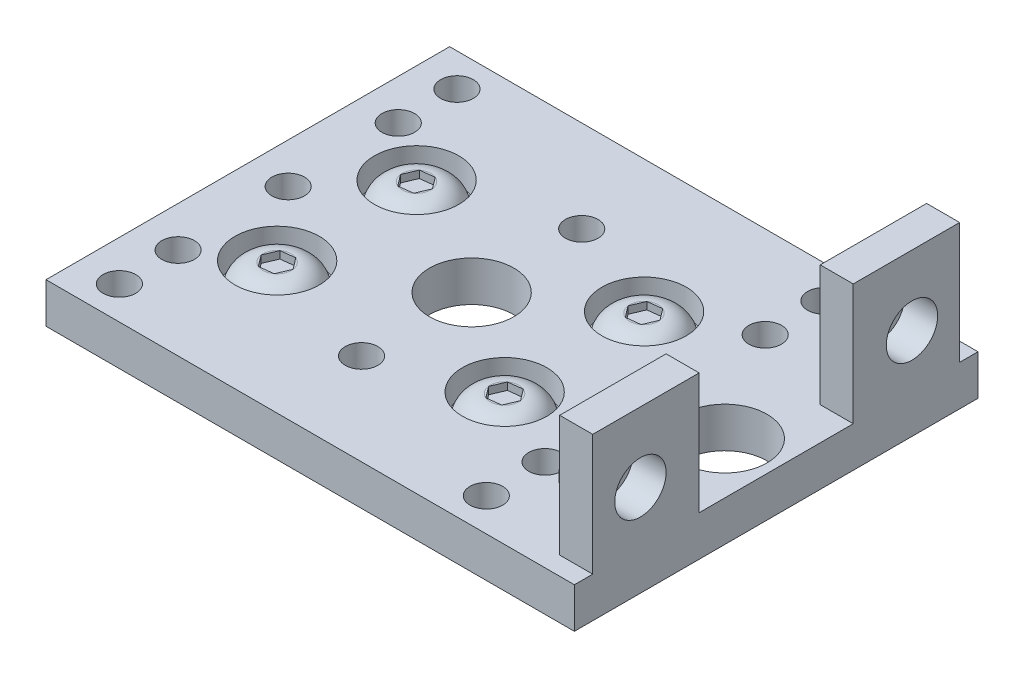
ISO-10303-21;
HEADER;
FILE_DESCRIPTION(('STEP AP214'),'2;1');
FILE_NAME('part.step','',(''),(''),'','','');
FILE_SCHEMA(('AUTOMOTIVE_DESIGN { 1 0 10303 214 1 1 1 1 }'));
ENDSEC;
DATA;
#1=APPLICATION_CONTEXT('core data for automotive mechanical design processes');
#2=APPLICATION_PROTOCOL_DEFINITION('international standard','automotive_design',2000,#1);
#3=PRODUCT_CONTEXT('',#1,'mechanical');
#4=PRODUCT('Part','Part','',(#3));
#5=PRODUCT_RELATED_PRODUCT_CATEGORY('part','',(#4));
#6=PRODUCT_DEFINITION_FORMATION('','',#4);
#7=PRODUCT_DEFINITION_CONTEXT('part definition',#1,'design');
#8=PRODUCT_DEFINITION('design','',#6,#7);
#9=PRODUCT_DEFINITION_SHAPE('','',#8);
#10=(LENGTH_UNIT() NAMED_UNIT(*) SI_UNIT(.MILLI.,.METRE.));
#11=(NAMED_UNIT(*) PLANE_ANGLE_UNIT() SI_UNIT($,.RADIAN.));
#12=(NAMED_UNIT(*) SI_UNIT($,.STERADIAN.) SOLID_ANGLE_UNIT());
#13=UNCERTAINTY_MEASURE_WITH_UNIT(LENGTH_MEASURE(1.E-05),#10,'distance_accuracy_value','');
#14=(GEOMETRIC_REPRESENTATION_CONTEXT(3) GLOBAL_UNCERTAINTY_ASSIGNED_CONTEXT((#13)) GLOBAL_UNIT_ASSIGNED_CONTEXT((#10,
#11,#12)) REPRESENTATION_CONTEXT('',''));
#15=CARTESIAN_POINT('',(0.,0.,0.));
#16=DIRECTION('',(0.,0.,1.));
#17=DIRECTION('',(1.,0.,0.));
#18=AXIS2_PLACEMENT_3D('',#15,#16,#17);
#19=CARTESIAN_POINT('',(32.6077445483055,6.35,-22.3769054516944));
#20=DIRECTION('',(1.,0.,0.));
#21=DIRECTION('',(0.,0.,-1.));
#22=AXIS2_PLACEMENT_3D('',#19,#20,#21);
#23=PLANE('',#22);
#24=CARTESIAN_POINT('',(32.6077445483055,6.35,-23.368));
#25=DIRECTION('',(1.,0.,0.));
#26=DIRECTION('',(0.,0.,-1.));
#27=AXIS2_PLACEMENT_3D('',#24,#25,#26);
#28=CIRCLE('',#27,0.991094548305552);
#29=CARTESIAN_POINT('',(32.6077445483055,7.22788365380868,-22.9080122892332));
#30=VERTEX_POINT('',#29);
#31=CARTESIAN_POINT('',(32.6077445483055,6.39058078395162,-22.3777365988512));
#32=VERTEX_POINT('',#31);
#33=EDGE_CURVE('E396',#30,#32,#28,.T.);
#34=ORIENTED_EDGE('',*,*,#33,.F.);
#35=DIRECTION('',(0.,0.844826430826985,-0.535040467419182));
#36=VECTOR('',#35,1.);
#37=CARTESIAN_POINT('',(32.6077445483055,6.39058078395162,-22.3777365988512));
#38=LINE('',#37,#36);
#39=EDGE_CURVE('E48',#32,#30,#38,.T.);
#40=ORIENTED_EDGE('',*,*,#39,.F.);
#41=EDGE_LOOP('',(#34,#40));
#42=FACE_BOUND('',#41,.T.);
#43=ADVANCED_FACE('F33',(#42),#23,.F.);
#44=CARTESIAN_POINT('',(32.6077445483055,5.51269713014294,-22.837724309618));
#45=VERTEX_POINT('',#44);
#46=EDGE_CURVE('E985',#32,#45,#28,.T.);
#47=ORIENTED_EDGE('',*,*,#46,.F.);
#48=DIRECTION('',(0.,0.885771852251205,0.464120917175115));
#49=VECTOR('',#48,1.);
#50=CARTESIAN_POINT('',(32.6077445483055,5.51269713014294,-22.837724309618));
#51=LINE('',#50,#49);
#52=EDGE_CURVE('E359',#45,#32,#51,.T.);
#53=ORIENTED_EDGE('',*,*,#52,.F.);
#54=EDGE_LOOP('',(#47,#53));
#55=FACE_BOUND('',#54,.T.);
#56=ADVANCED_FACE('F934',(#55),#23,.F.);
#57=CARTESIAN_POINT('',(32.6077445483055,5.47211634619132,-23.8279877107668));
#58=VERTEX_POINT('',#57);
#59=EDGE_CURVE('E983',#45,#58,#28,.T.);
#60=ORIENTED_EDGE('',*,*,#59,.F.);
#61=DIRECTION('',(0.,0.0409454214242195,0.999161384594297));
#62=VECTOR('',#61,1.);
#63=CARTESIAN_POINT('',(32.6077445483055,5.47211634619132,-23.8279877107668));
#64=LINE('',#63,#62);
#65=EDGE_CURVE('E362',#58,#45,#64,.T.);
#66=ORIENTED_EDGE('',*,*,#65,.F.);
#67=EDGE_LOOP('',(#60,#66));
#68=FACE_BOUND('',#67,.T.);
#69=ADVANCED_FACE('F942',(#68),#23,.F.);
#70=CARTESIAN_POINT('',(32.6077445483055,6.30941921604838,-24.3582634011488));
#71=VERTEX_POINT('',#70);
#72=EDGE_CURVE('E978',#58,#71,#28,.T.);
#73=ORIENTED_EDGE('',*,*,#72,.F.);
#74=DIRECTION('',(0.,-0.844826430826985,0.535040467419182));
#75=VECTOR('',#74,1.);
#76=CARTESIAN_POINT('',(32.6077445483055,6.30941921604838,-24.3582634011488));
#77=LINE('',#76,#75);
#78=EDGE_CURVE('E378',#71,#58,#77,.T.);
#79=ORIENTED_EDGE('',*,*,#78,.F.);
#80=EDGE_LOOP('',(#73,#79));
#81=FACE_BOUND('',#80,.T.);
#82=ADVANCED_FACE('F962',(#81),#23,.F.);
#83=CARTESIAN_POINT('',(32.6077445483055,7.18730286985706,-23.898275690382));
#84=VERTEX_POINT('',#83);
#85=EDGE_CURVE('E385',#71,#84,#28,.T.);
#86=ORIENTED_EDGE('',*,*,#85,.F.);
#87=DIRECTION('',(0.,-0.885771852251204,-0.464120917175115));
#88=VECTOR('',#87,1.);
#89=CARTESIAN_POINT('',(32.6077445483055,7.18730286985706,-23.898275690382));
#90=LINE('',#89,#88);
#91=EDGE_CURVE('E375',#84,#71,#90,.T.);
#92=ORIENTED_EDGE('',*,*,#91,.F.);
#93=EDGE_LOOP('',(#86,#92));
#94=FACE_BOUND('',#93,.T.);
#95=ADVANCED_FACE('F950',(#94),#23,.F.);
#96=CARTESIAN_POINT('',(34.29,11.176,-26.67));
#97=DIRECTION('',(1.,0.,0.));
#98=DIRECTION('',(0.,0.,-1.));
#99=AXIS2_PLACEMENT_3D('',#96,#97,#98);
#100=PLANE('',#99);
#101=DIRECTION('',(0.,0.,-1.));
#102=VECTOR('',#101,1.);
#103=CARTESIAN_POINT('',(34.29,2.794,0.));
#104=LINE('',#103,#102);
#105=CARTESIAN_POINT('',(34.29,2.794,-19.304));
#106=VERTEX_POINT('',#105);
#107=CARTESIAN_POINT('',(34.29,2.794,-26.67));
#108=VERTEX_POINT('',#107);
#109=EDGE_CURVE('E838',#106,#108,#104,.T.);
#110=ORIENTED_EDGE('',*,*,#109,.F.);
#111=DIRECTION('',(0.,-1.,0.));
#112=VECTOR('',#111,1.);
#113=CARTESIAN_POINT('',(34.29,11.176,-19.304));
#114=LINE('',#113,#112);
#115=CARTESIAN_POINT('',(34.29,11.176,-19.304));
#116=VERTEX_POINT('',#115);
#117=EDGE_CURVE('E828',#116,#106,#114,.T.);
#118=ORIENTED_EDGE('',*,*,#117,.F.);
#119=DIRECTION('',(0.,0.,1.));
#120=VECTOR('',#119,1.);
#121=CARTESIAN_POINT('',(34.29,11.176,-26.67));
#122=LINE('',#121,#120);
#123=CARTESIAN_POINT('',(34.29,11.176,-26.67));
#124=VERTEX_POINT('',#123);
#125=EDGE_CURVE('E821',#124,#116,#122,.T.);
#126=ORIENTED_EDGE('',*,*,#125,.F.);
#127=DIRECTION('',(0.,-1.,0.));
#128=VECTOR('',#127,1.);
#129=CARTESIAN_POINT('',(34.29,11.176,-26.67));
#130=LINE('',#129,#128);
#131=EDGE_CURVE('E830',#124,#108,#130,.T.);
#132=ORIENTED_EDGE('',*,*,#131,.T.);
#133=EDGE_LOOP('',(#110,#118,#126,#132));
#134=FACE_BOUND('',#133,.T.);
#135=CARTESIAN_POINT('',(34.29,6.35,-23.368));
#136=DIRECTION('',(1.,0.,0.));
#137=DIRECTION('',(0.,0.,-1.));
#138=AXIS2_PLACEMENT_3D('',#135,#136,#137);
#139=CIRCLE('',#138,2.67335000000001);
#140=CARTESIAN_POINT('',(34.29,6.35,-26.04135));
#141=VERTEX_POINT('',#140);
#142=EDGE_CURVE('E11',#141,#141,#139,.F.);
#143=ORIENTED_EDGE('',*,*,#142,.F.);
#144=EDGE_LOOP('',(#143));
#145=FACE_BOUND('',#144,.T.);
#146=ADVANCED_FACE('F961',(#134,#145),#100,.F.);
#147=CARTESIAN_POINT('',(32.6077445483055,6.35,-3.58090545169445));
#148=DIRECTION('',(1.,0.,0.));
#149=DIRECTION('',(0.,0.,-1.));
#150=AXIS2_PLACEMENT_3D('',#147,#148,#149);
#151=PLANE('',#150);
#152=CARTESIAN_POINT('',(32.6077445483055,6.35,-4.572));
#153=DIRECTION('',(1.,0.,0.));
#154=DIRECTION('',(0.,0.,-1.));
#155=AXIS2_PLACEMENT_3D('',#152,#153,#154);
#156=CIRCLE('',#155,0.991094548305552);
#157=CARTESIAN_POINT('',(32.6077445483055,7.22788365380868,-4.11201228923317));
#158=VERTEX_POINT('',#157);
#159=CARTESIAN_POINT('',(32.6077445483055,6.39058078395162,-3.58173659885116));
#160=VERTEX_POINT('',#159);
#161=EDGE_CURVE('E448',#158,#160,#156,.T.);
#162=ORIENTED_EDGE('',*,*,#161,.F.);
#163=DIRECTION('',(0.,0.844826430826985,-0.535040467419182));
#164=VECTOR('',#163,1.);
#165=CARTESIAN_POINT('',(32.6077445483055,6.39058078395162,-3.58173659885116));
#166=LINE('',#165,#164);
#167=EDGE_CURVE('E56',#160,#158,#166,.T.);
#168=ORIENTED_EDGE('',*,*,#167,.F.);
#169=EDGE_LOOP('',(#162,#168));
#170=FACE_BOUND('',#169,.T.);
#171=ADVANCED_FACE('F969',(#170),#151,.F.);
#172=CARTESIAN_POINT('',(32.6077445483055,5.51269713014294,-4.04172430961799));
#173=VERTEX_POINT('',#172);
#174=EDGE_CURVE('E1880',#160,#173,#156,.T.);
#175=ORIENTED_EDGE('',*,*,#174,.F.);
#176=DIRECTION('',(0.,0.885771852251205,0.464120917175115));
#177=VECTOR('',#176,1.);
#178=CARTESIAN_POINT('',(32.6077445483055,5.51269713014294,-4.04172430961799));
#179=LINE('',#178,#177);
#180=EDGE_CURVE('E401',#173,#160,#179,.T.);
#181=ORIENTED_EDGE('',*,*,#180,.F.);
#182=EDGE_LOOP('',(#175,#181));
#183=FACE_BOUND('',#182,.T.);
#184=ADVANCED_FACE('F1687',(#183),#151,.F.);
#185=CARTESIAN_POINT('',(32.6077445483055,5.47211634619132,-5.03198771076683));
#186=VERTEX_POINT('',#185);
#187=EDGE_CURVE('E1879',#173,#186,#156,.T.);
#188=ORIENTED_EDGE('',*,*,#187,.F.);
#189=DIRECTION('',(0.,0.0409454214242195,0.999161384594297));
#190=VECTOR('',#189,1.);
#191=CARTESIAN_POINT('',(32.6077445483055,5.47211634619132,-5.03198771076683));
#192=LINE('',#191,#190);
#193=EDGE_CURVE('E427',#186,#173,#192,.T.);
#194=ORIENTED_EDGE('',*,*,#193,.F.);
#195=EDGE_LOOP('',(#188,#194));
#196=FACE_BOUND('',#195,.T.);
#197=ADVANCED_FACE('F1679',(#196),#151,.F.);
#198=CARTESIAN_POINT('',(32.6077445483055,6.30941921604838,-5.56226340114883));
#199=VERTEX_POINT('',#198);
#200=EDGE_CURVE('E1878',#186,#199,#156,.T.);
#201=ORIENTED_EDGE('',*,*,#200,.F.);
#202=DIRECTION('',(0.,-0.844826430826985,0.535040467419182));
#203=VECTOR('',#202,1.);
#204=CARTESIAN_POINT('',(32.6077445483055,6.30941921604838,-5.56226340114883));
#205=LINE('',#204,#203);
#206=EDGE_CURVE('E424',#199,#186,#205,.T.);
#207=ORIENTED_EDGE('',*,*,#206,.F.);
#208=EDGE_LOOP('',(#201,#207));
#209=FACE_BOUND('',#208,.T.);
#210=ADVANCED_FACE('F926',(#209),#151,.F.);
#211=CARTESIAN_POINT('',(32.6077445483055,7.18730286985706,-5.102275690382));
#212=VERTEX_POINT('',#211);
#213=EDGE_CURVE('E434',#199,#212,#156,.T.);
#214=ORIENTED_EDGE('',*,*,#213,.F.);
#215=DIRECTION('',(0.,-0.885771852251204,-0.464120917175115));
#216=VECTOR('',#215,1.);
#217=CARTESIAN_POINT('',(32.6077445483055,7.18730286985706,-5.102275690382));
#218=LINE('',#217,#216);
#219=EDGE_CURVE('E421',#212,#199,#218,.T.);
#220=ORIENTED_EDGE('',*,*,#219,.F.);
#221=EDGE_LOOP('',(#214,#220));
#222=FACE_BOUND('',#221,.T.);
#223=ADVANCED_FACE('F913',(#222),#151,.F.);
#224=CARTESIAN_POINT('',(34.29,11.176,-8.63599999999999));
#225=DIRECTION('',(1.,0.,0.));
#226=DIRECTION('',(0.,0.,-1.));
#227=AXIS2_PLACEMENT_3D('',#224,#225,#226);
#228=PLANE('',#227);
#229=DIRECTION('',(0.,0.,-1.));
#230=VECTOR('',#229,1.);
#231=CARTESIAN_POINT('',(34.29,2.794,0.));
#232=LINE('',#231,#230);
#233=CARTESIAN_POINT('',(34.29,2.794,-1.27));
#234=VERTEX_POINT('',#233);
#235=CARTESIAN_POINT('',(34.29,2.794,-8.63599999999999));
#236=VERTEX_POINT('',#235);
#237=EDGE_CURVE('E810',#234,#236,#232,.T.);
#238=ORIENTED_EDGE('',*,*,#237,.F.);
#239=DIRECTION('',(0.,-1.,0.));
#240=VECTOR('',#239,1.);
#241=CARTESIAN_POINT('',(34.29,11.176,-1.27));
#242=LINE('',#241,#240);
#243=CARTESIAN_POINT('',(34.29,11.176,-1.27));
#244=VERTEX_POINT('',#243);
#245=EDGE_CURVE('E800',#244,#234,#242,.T.);
#246=ORIENTED_EDGE('',*,*,#245,.F.);
#247=DIRECTION('',(0.,0.,1.));
#248=VECTOR('',#247,1.);
#249=CARTESIAN_POINT('',(34.29,11.176,-8.63599999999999));
#250=LINE('',#249,#248);
#251=CARTESIAN_POINT('',(34.29,11.176,-8.63599999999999));
#252=VERTEX_POINT('',#251);
#253=EDGE_CURVE('E793',#252,#244,#250,.T.);
#254=ORIENTED_EDGE('',*,*,#253,.F.);
#255=DIRECTION('',(0.,-1.,0.));
#256=VECTOR('',#255,1.);
#257=CARTESIAN_POINT('',(34.29,11.176,-8.63599999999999));
#258=LINE('',#257,#256);
#259=EDGE_CURVE('E802',#252,#236,#258,.T.);
#260=ORIENTED_EDGE('',*,*,#259,.T.);
#261=EDGE_LOOP('',(#238,#246,#254,#260));
#262=FACE_BOUND('',#261,.T.);
#263=CARTESIAN_POINT('',(34.29,6.35,-4.572));
#264=DIRECTION('',(1.,0.,0.));
#265=DIRECTION('',(0.,0.,-1.));
#266=AXIS2_PLACEMENT_3D('',#263,#264,#265);
#267=CIRCLE('',#266,2.67335000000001);
#268=CARTESIAN_POINT('',(34.29,6.35,-7.24535));
#269=VERTEX_POINT('',#268);
#270=EDGE_CURVE('E41',#269,#269,#267,.F.);
#271=ORIENTED_EDGE('',*,*,#270,.F.);
#272=EDGE_LOOP('',(#271));
#273=FACE_BOUND('',#272,.T.);
#274=ADVANCED_FACE('F910',(#262,#273),#228,.F.);
#275=CARTESIAN_POINT('',(21.6085554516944,2.69825545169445,-18.796));
#276=DIRECTION('',(0.,-1.,0.));
#277=DIRECTION('',(0.,0.,-1.));
#278=AXIS2_PLACEMENT_3D('',#275,#276,#277);
#279=PLANE('',#278);
#280=CARTESIAN_POINT('',(22.59965,2.69825545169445,-18.796));
#281=DIRECTION('',(0.,-1.,0.));
#282=DIRECTION('',(0.,0.,-1.));
#283=AXIS2_PLACEMENT_3D('',#280,#281,#282);
#284=CIRCLE('',#283,0.991094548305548);
#285=CARTESIAN_POINT('',(22.9865464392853,2.69825545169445,-19.7084579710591));
#286=VERTEX_POINT('',#285);
#287=CARTESIAN_POINT('',(23.5833100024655,2.69825545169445,-18.9171668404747));
#288=VERTEX_POINT('',#287);
#289=EDGE_CURVE('E596',#286,#288,#284,.T.);
#290=ORIENTED_EDGE('',*,*,#289,.F.);
#291=DIRECTION('',(-0.60212576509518,0.,-0.798401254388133));
#292=VECTOR('',#291,1.);
#293=CARTESIAN_POINT('',(23.5833100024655,2.69825545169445,-18.9171668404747));
#294=LINE('',#293,#292);
#295=EDGE_CURVE('E447',#288,#286,#294,.T.);
#296=ORIENTED_EDGE('',*,*,#295,.F.);
#297=EDGE_LOOP('',(#290,#296));
#298=FACE_BOUND('',#297,.T.);
#299=ADVANCED_FACE('F912',(#298),#279,.F.);
#300=CARTESIAN_POINT('',(23.1964135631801,2.69825545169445,-18.0047088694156));
#301=VERTEX_POINT('',#300);
#302=EDGE_CURVE('E600',#288,#301,#284,.T.);
#303=ORIENTED_EDGE('',*,*,#302,.F.);
#304=DIRECTION('',(0.390372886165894,0.,-0.920656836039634));
#305=VECTOR('',#304,1.);
#306=CARTESIAN_POINT('',(23.1964135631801,2.69825545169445,-18.0047088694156));
#307=LINE('',#306,#305);
#308=EDGE_CURVE('E453',#301,#288,#307,.T.);
#309=ORIENTED_EDGE('',*,*,#308,.F.);
#310=EDGE_LOOP('',(#303,#309));
#311=FACE_BOUND('',#310,.T.);
#312=ADVANCED_FACE('F921',(#311),#279,.F.);
#313=CARTESIAN_POINT('',(22.2127535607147,2.69825545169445,-17.8835420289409));
#314=VERTEX_POINT('',#313);
#315=EDGE_CURVE('E2401',#301,#314,#284,.T.);
#316=ORIENTED_EDGE('',*,*,#315,.F.);
#317=DIRECTION('',(0.992498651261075,0.,-0.1222555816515));
#318=VECTOR('',#317,1.);
#319=CARTESIAN_POINT('',(22.2127535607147,2.69825545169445,-17.8835420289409));
#320=LINE('',#319,#318);
#321=EDGE_CURVE('E479',#314,#301,#320,.T.);
#322=ORIENTED_EDGE('',*,*,#321,.F.);
#323=EDGE_LOOP('',(#316,#322));
#324=FACE_BOUND('',#323,.T.);
#325=ADVANCED_FACE('F1902',(#324),#279,.F.);
#326=CARTESIAN_POINT('',(21.6159899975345,2.69825545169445,-18.6748331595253));
#327=VERTEX_POINT('',#326);
#328=EDGE_CURVE('E2396',#314,#327,#284,.T.);
#329=ORIENTED_EDGE('',*,*,#328,.F.);
#330=DIRECTION('',(0.60212576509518,0.,0.798401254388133));
#331=VECTOR('',#330,1.);
#332=CARTESIAN_POINT('',(21.6159899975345,2.69825545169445,-18.6748331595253));
#333=LINE('',#332,#331);
#334=EDGE_CURVE('E476',#327,#314,#333,.T.);
#335=ORIENTED_EDGE('',*,*,#334,.F.);
#336=EDGE_LOOP('',(#329,#335));
#337=FACE_BOUND('',#336,.T.);
#338=ADVANCED_FACE('F1909',(#337),#279,.F.);
#339=CARTESIAN_POINT('',(22.0028864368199,2.69825545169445,-19.5872911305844));
#340=VERTEX_POINT('',#339);
#341=EDGE_CURVE('E2391',#327,#340,#284,.T.);
#342=ORIENTED_EDGE('',*,*,#341,.F.);
#343=DIRECTION('',(-0.390372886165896,0.,0.920656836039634));
#344=VECTOR('',#343,1.);
#345=CARTESIAN_POINT('',(22.0028864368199,2.69825545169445,-19.5872911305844));
#346=LINE('',#345,#344);
#347=EDGE_CURVE('E473',#340,#327,#346,.T.);
#348=ORIENTED_EDGE('',*,*,#347,.F.);
#349=EDGE_LOOP('',(#342,#348));
#350=FACE_BOUND('',#349,.T.);
#351=ADVANCED_FACE('F1220',(#350),#279,.F.);
#352=CARTESIAN_POINT('',(5.86055545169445,2.69825545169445,-18.796));
#353=DIRECTION('',(0.,-1.,0.));
#354=DIRECTION('',(0.,0.,-1.));
#355=AXIS2_PLACEMENT_3D('',#352,#353,#354);
#356=PLANE('',#355);
#357=CARTESIAN_POINT('',(6.85165,2.69825545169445,-18.796));
#358=DIRECTION('',(0.,-1.,0.));
#359=DIRECTION('',(0.,0.,-1.));
#360=AXIS2_PLACEMENT_3D('',#357,#358,#359);
#361=CIRCLE('',#360,0.991094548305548);
#362=CARTESIAN_POINT('',(7.23854643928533,2.69825545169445,-19.7084579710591));
#363=VERTEX_POINT('',#362);
#364=CARTESIAN_POINT('',(7.83531000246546,2.69825545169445,-18.9171668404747));
#365=VERTEX_POINT('',#364);
#366=EDGE_CURVE('E607',#363,#365,#361,.T.);
#367=ORIENTED_EDGE('',*,*,#366,.F.);
#368=DIRECTION('',(-0.60212576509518,0.,-0.798401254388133));
#369=VECTOR('',#368,1.);
#370=CARTESIAN_POINT('',(7.83531000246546,2.69825545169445,-18.9171668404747));
#371=LINE('',#370,#369);
#372=EDGE_CURVE('E486',#365,#363,#371,.T.);
#373=ORIENTED_EDGE('',*,*,#372,.F.);
#374=EDGE_LOOP('',(#367,#373));
#375=FACE_BOUND('',#374,.T.);
#376=ADVANCED_FACE('F1233',(#375),#356,.F.);
#377=CARTESIAN_POINT('',(7.44841356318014,2.69825545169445,-18.0047088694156));
#378=VERTEX_POINT('',#377);
#379=EDGE_CURVE('E611',#365,#378,#361,.T.);
#380=ORIENTED_EDGE('',*,*,#379,.F.);
#381=DIRECTION('',(0.390372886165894,0.,-0.920656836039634));
#382=VECTOR('',#381,1.);
#383=CARTESIAN_POINT('',(7.44841356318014,2.69825545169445,-18.0047088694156));
#384=LINE('',#383,#382);
#385=EDGE_CURVE('E501',#378,#365,#384,.T.);
#386=ORIENTED_EDGE('',*,*,#385,.F.);
#387=EDGE_LOOP('',(#380,#386));
#388=FACE_BOUND('',#387,.T.);
#389=ADVANCED_FACE('F1928',(#388),#356,.F.);
#390=CARTESIAN_POINT('',(6.46475356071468,2.69825545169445,-17.8835420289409));
#391=VERTEX_POINT('',#390);
#392=EDGE_CURVE('E2374',#378,#391,#361,.T.);
#393=ORIENTED_EDGE('',*,*,#392,.F.);
#394=DIRECTION('',(0.992498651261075,0.,-0.1222555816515));
#395=VECTOR('',#394,1.);
#396=CARTESIAN_POINT('',(6.46475356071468,2.69825545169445,-17.8835420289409));
#397=LINE('',#396,#395);
#398=EDGE_CURVE('E527',#391,#378,#397,.T.);
#399=ORIENTED_EDGE('',*,*,#398,.F.);
#400=EDGE_LOOP('',(#393,#399));
#401=FACE_BOUND('',#400,.T.);
#402=ADVANCED_FACE('F1935',(#401),#356,.F.);
#403=CARTESIAN_POINT('',(5.86798999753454,2.69825545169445,-18.6748331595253));
#404=VERTEX_POINT('',#403);
#405=EDGE_CURVE('E2369',#391,#404,#361,.T.);
#406=ORIENTED_EDGE('',*,*,#405,.F.);
#407=DIRECTION('',(0.60212576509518,0.,0.798401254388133));
#408=VECTOR('',#407,1.);
#409=CARTESIAN_POINT('',(5.86798999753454,2.69825545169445,-18.6748331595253));
#410=LINE('',#409,#408);
#411=EDGE_CURVE('E524',#404,#391,#410,.T.);
#412=ORIENTED_EDGE('',*,*,#411,.F.);
#413=EDGE_LOOP('',(#406,#412));
#414=FACE_BOUND('',#413,.T.);
#415=ADVANCED_FACE('F1942',(#414),#356,.F.);
#416=CARTESIAN_POINT('',(6.25488643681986,2.69825545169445,-19.5872911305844));
#417=VERTEX_POINT('',#416);
#418=EDGE_CURVE('E2364',#404,#417,#361,.T.);
#419=ORIENTED_EDGE('',*,*,#418,.F.);
#420=DIRECTION('',(-0.390372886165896,0.,0.920656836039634));
#421=VECTOR('',#420,1.);
#422=CARTESIAN_POINT('',(6.25488643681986,2.69825545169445,-19.5872911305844));
#423=LINE('',#422,#421);
#424=EDGE_CURVE('E521',#417,#404,#423,.T.);
#425=ORIENTED_EDGE('',*,*,#424,.F.);
#426=EDGE_LOOP('',(#419,#425));
#427=FACE_BOUND('',#426,.T.);
#428=ADVANCED_FACE('F1234',(#427),#356,.F.);
#429=CARTESIAN_POINT('',(21.6085554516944,2.69825545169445,-9.144));
#430=DIRECTION('',(0.,-1.,0.));
#431=DIRECTION('',(0.,0.,-1.));
#432=AXIS2_PLACEMENT_3D('',#429,#430,#431);
#433=PLANE('',#432);
#434=CARTESIAN_POINT('',(22.59965,2.69825545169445,-9.144));
#435=DIRECTION('',(0.,-1.,0.));
#436=DIRECTION('',(0.,0.,-1.));
#437=AXIS2_PLACEMENT_3D('',#434,#435,#436);
#438=CIRCLE('',#437,0.991094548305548);
#439=CARTESIAN_POINT('',(22.9865464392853,2.69825545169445,-10.0564579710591));
#440=VERTEX_POINT('',#439);
#441=CARTESIAN_POINT('',(23.5833100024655,2.69825545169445,-9.26516684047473));
#442=VERTEX_POINT('',#441);
#443=EDGE_CURVE('E618',#440,#442,#438,.T.);
#444=ORIENTED_EDGE('',*,*,#443,.F.);
#445=DIRECTION('',(-0.60212576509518,0.,-0.798401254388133));
#446=VECTOR('',#445,1.);
#447=CARTESIAN_POINT('',(23.5833100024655,2.69825545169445,-9.26516684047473));
#448=LINE('',#447,#446);
#449=EDGE_CURVE('E534',#442,#440,#448,.T.);
#450=ORIENTED_EDGE('',*,*,#449,.F.);
#451=EDGE_LOOP('',(#444,#450));
#452=FACE_BOUND('',#451,.T.);
#453=ADVANCED_FACE('F1247',(#452),#433,.F.);
#454=CARTESIAN_POINT('',(23.1964135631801,2.69825545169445,-8.35270886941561));
#455=VERTEX_POINT('',#454);
#456=EDGE_CURVE('E622',#442,#455,#438,.T.);
#457=ORIENTED_EDGE('',*,*,#456,.F.);
#458=DIRECTION('',(0.390372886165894,0.,-0.920656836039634));
#459=VECTOR('',#458,1.);
#460=CARTESIAN_POINT('',(23.1964135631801,2.69825545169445,-8.35270886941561));
#461=LINE('',#460,#459);
#462=EDGE_CURVE('E549',#455,#442,#461,.T.);
#463=ORIENTED_EDGE('',*,*,#462,.F.);
#464=EDGE_LOOP('',(#457,#463));
#465=FACE_BOUND('',#464,.T.);
#466=ADVANCED_FACE('F1961',(#465),#433,.F.);
#467=CARTESIAN_POINT('',(22.2127535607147,2.69825545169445,-8.23154202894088));
#468=VERTEX_POINT('',#467);
#469=EDGE_CURVE('E2347',#455,#468,#438,.T.);
#470=ORIENTED_EDGE('',*,*,#469,.F.);
#471=DIRECTION('',(0.992498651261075,0.,-0.1222555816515));
#472=VECTOR('',#471,1.);
#473=CARTESIAN_POINT('',(22.2127535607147,2.69825545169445,-8.23154202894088));
#474=LINE('',#473,#472);
#475=EDGE_CURVE('E575',#468,#455,#474,.T.);
#476=ORIENTED_EDGE('',*,*,#475,.F.);
#477=EDGE_LOOP('',(#470,#476));
#478=FACE_BOUND('',#477,.T.);
#479=ADVANCED_FACE('F1968',(#478),#433,.F.);
#480=CARTESIAN_POINT('',(21.6159899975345,2.69825545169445,-9.02283315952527));
#481=VERTEX_POINT('',#480);
#482=EDGE_CURVE('E2342',#468,#481,#438,.T.);
#483=ORIENTED_EDGE('',*,*,#482,.F.);
#484=DIRECTION('',(0.60212576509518,0.,0.798401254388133));
#485=VECTOR('',#484,1.);
#486=CARTESIAN_POINT('',(21.6159899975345,2.69825545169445,-9.02283315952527));
#487=LINE('',#486,#485);
#488=EDGE_CURVE('E572',#481,#468,#487,.T.);
#489=ORIENTED_EDGE('',*,*,#488,.F.);
#490=EDGE_LOOP('',(#483,#489));
#491=FACE_BOUND('',#490,.T.);
#492=ADVANCED_FACE('F1975',(#491),#433,.F.);
#493=CARTESIAN_POINT('',(22.0028864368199,2.69825545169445,-9.93529113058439));
#494=VERTEX_POINT('',#493);
#495=EDGE_CURVE('E2337',#481,#494,#438,.T.);
#496=ORIENTED_EDGE('',*,*,#495,.F.);
#497=DIRECTION('',(-0.390372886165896,0.,0.920656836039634));
#498=VECTOR('',#497,1.);
#499=CARTESIAN_POINT('',(22.0028864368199,2.69825545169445,-9.93529113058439));
#500=LINE('',#499,#498);
#501=EDGE_CURVE('E569',#494,#481,#500,.T.);
#502=ORIENTED_EDGE('',*,*,#501,.F.);
#503=EDGE_LOOP('',(#496,#502));
#504=FACE_BOUND('',#503,.T.);
#505=ADVANCED_FACE('F1248',(#504),#433,.F.);
#506=CARTESIAN_POINT('',(22.606,1.016,-18.796));
#507=DIRECTION('',(0.,1.,0.));
#508=DIRECTION('',(0.,0.,1.));
#509=AXIS2_PLACEMENT_3D('',#506,#507,#508);
#510=PLANE('',#509);
#511=CARTESIAN_POINT('',(22.606,1.016,-18.796));
#512=DIRECTION('',(0.,1.,0.));
#513=DIRECTION('',(0.,0.,1.));
#514=AXIS2_PLACEMENT_3D('',#511,#512,#513);
#515=CIRCLE('',#514,2.921);
#516=CARTESIAN_POINT('',(22.606,1.016,-15.875));
#517=VERTEX_POINT('',#516);
#518=EDGE_CURVE('E721',#517,#517,#515,.T.);
#519=ORIENTED_EDGE('',*,*,#518,.T.);
#520=EDGE_LOOP('',(#519));
#521=FACE_BOUND('',#520,.T.);
#522=CARTESIAN_POINT('',(22.59965,1.016,-18.796));
#523=DIRECTION('',(0.,-1.,0.));
#524=DIRECTION('',(0.,0.,-1.));
#525=AXIS2_PLACEMENT_3D('',#522,#523,#524);
#526=CIRCLE('',#525,2.67335);
#527=CARTESIAN_POINT('',(22.59965,1.016,-21.46935));
#528=VERTEX_POINT('',#527);
#529=EDGE_CURVE('E582',#528,#528,#526,.T.);
#530=ORIENTED_EDGE('',*,*,#529,.T.);
#531=EDGE_LOOP('',(#530));
#532=FACE_BOUND('',#531,.T.);
#533=ADVANCED_FACE('F1330',(#521,#532),#510,.T.);
#534=CARTESIAN_POINT('',(6.858,1.016,-18.796));
#535=DIRECTION('',(0.,1.,0.));
#536=DIRECTION('',(0.,0.,1.));
#537=AXIS2_PLACEMENT_3D('',#534,#535,#536);
#538=PLANE('',#537);
#539=CARTESIAN_POINT('',(6.858,1.016,-18.796));
#540=DIRECTION('',(0.,1.,0.));
#541=DIRECTION('',(0.,0.,1.));
#542=AXIS2_PLACEMENT_3D('',#539,#540,#541);
#543=CIRCLE('',#542,2.921);
#544=CARTESIAN_POINT('',(6.858,1.016,-15.875));
#545=VERTEX_POINT('',#544);
#546=EDGE_CURVE('E727',#545,#545,#543,.T.);
#547=ORIENTED_EDGE('',*,*,#546,.T.);
#548=EDGE_LOOP('',(#547));
#549=FACE_BOUND('',#548,.T.);
#550=CARTESIAN_POINT('',(6.85165,1.016,-18.796));
#551=DIRECTION('',(0.,-1.,0.));
#552=DIRECTION('',(0.,0.,-1.));
#553=AXIS2_PLACEMENT_3D('',#550,#551,#552);
#554=CIRCLE('',#553,2.67335);
#555=CARTESIAN_POINT('',(6.85165,1.016,-21.46935));
#556=VERTEX_POINT('',#555);
#557=EDGE_CURVE('E603',#556,#556,#554,.T.);
#558=ORIENTED_EDGE('',*,*,#557,.T.);
#559=EDGE_LOOP('',(#558));
#560=FACE_BOUND('',#559,.T.);
#561=ADVANCED_FACE('F1324',(#549,#560),#538,.T.);
#562=CARTESIAN_POINT('',(22.606,1.016,-9.144));
#563=DIRECTION('',(0.,1.,0.));
#564=DIRECTION('',(0.,0.,1.));
#565=AXIS2_PLACEMENT_3D('',#562,#563,#564);
#566=PLANE('',#565);
#567=CARTESIAN_POINT('',(22.606,1.016,-9.144));
#568=DIRECTION('',(0.,1.,0.));
#569=DIRECTION('',(0.,0.,1.));
#570=AXIS2_PLACEMENT_3D('',#567,#568,#569);
#571=CIRCLE('',#570,2.921);
#572=CARTESIAN_POINT('',(22.606,1.016,-6.223));
#573=VERTEX_POINT('',#572);
#574=EDGE_CURVE('E715',#573,#573,#571,.T.);
#575=ORIENTED_EDGE('',*,*,#574,.T.);
#576=EDGE_LOOP('',(#575));
#577=FACE_BOUND('',#576,.T.);
#578=CARTESIAN_POINT('',(22.59965,1.016,-9.144));
#579=DIRECTION('',(0.,-1.,0.));
#580=DIRECTION('',(0.,0.,-1.));
#581=AXIS2_PLACEMENT_3D('',#578,#579,#580);
#582=CIRCLE('',#581,2.67335);
#583=CARTESIAN_POINT('',(22.59965,1.016,-11.81735));
#584=VERTEX_POINT('',#583);
#585=EDGE_CURVE('E614',#584,#584,#582,.T.);
#586=ORIENTED_EDGE('',*,*,#585,.T.);
#587=EDGE_LOOP('',(#586));
#588=FACE_BOUND('',#587,.T.);
#589=ADVANCED_FACE('F1321',(#577,#588),#566,.T.);
#590=CARTESIAN_POINT('',(5.86055545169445,2.69825545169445,-9.144));
#591=DIRECTION('',(0.,-1.,0.));
#592=DIRECTION('',(0.,0.,-1.));
#593=AXIS2_PLACEMENT_3D('',#590,#591,#592);
#594=PLANE('',#593);
#595=CARTESIAN_POINT('',(6.85165,2.69825545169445,-9.144));
#596=DIRECTION('',(0.,-1.,0.));
#597=DIRECTION('',(0.,0.,-1.));
#598=AXIS2_PLACEMENT_3D('',#595,#596,#597);
#599=CIRCLE('',#598,0.991094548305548);
#600=CARTESIAN_POINT('',(7.23854643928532,2.69825545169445,-10.0564579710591));
#601=VERTEX_POINT('',#600);
#602=CARTESIAN_POINT('',(7.83531000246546,2.69825545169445,-9.26516684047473));
#603=VERTEX_POINT('',#602);
#604=EDGE_CURVE('E677',#601,#603,#599,.T.);
#605=ORIENTED_EDGE('',*,*,#604,.F.);
#606=DIRECTION('',(-0.60212576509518,0.,-0.798401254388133));
#607=VECTOR('',#606,1.);
#608=CARTESIAN_POINT('',(7.83531000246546,2.69825545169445,-9.26516684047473));
#609=LINE('',#608,#607);
#610=EDGE_CURVE('E625',#603,#601,#609,.T.);
#611=ORIENTED_EDGE('',*,*,#610,.F.);
#612=EDGE_LOOP('',(#605,#611));
#613=FACE_BOUND('',#612,.T.);
#614=ADVANCED_FACE('F1289',(#613),#594,.F.);
#615=CARTESIAN_POINT('',(7.44841356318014,2.69825545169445,-8.35270886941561));
#616=VERTEX_POINT('',#615);
#617=EDGE_CURVE('E681',#603,#616,#599,.T.);
#618=ORIENTED_EDGE('',*,*,#617,.F.);
#619=DIRECTION('',(0.390372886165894,0.,-0.920656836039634));
#620=VECTOR('',#619,1.);
#621=CARTESIAN_POINT('',(7.44841356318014,2.69825545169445,-8.35270886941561));
#622=LINE('',#621,#620);
#623=EDGE_CURVE('E630',#616,#603,#622,.T.);
#624=ORIENTED_EDGE('',*,*,#623,.F.);
#625=EDGE_LOOP('',(#618,#624));
#626=FACE_BOUND('',#625,.T.);
#627=ADVANCED_FACE('F2004',(#626),#594,.F.);
#628=CARTESIAN_POINT('',(6.46475356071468,2.69825545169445,-8.23154202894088));
#629=VERTEX_POINT('',#628);
#630=EDGE_CURVE('E2320',#616,#629,#599,.T.);
#631=ORIENTED_EDGE('',*,*,#630,.F.);
#632=DIRECTION('',(0.992498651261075,0.,-0.1222555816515));
#633=VECTOR('',#632,1.);
#634=CARTESIAN_POINT('',(6.46475356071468,2.69825545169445,-8.23154202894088));
#635=LINE('',#634,#633);
#636=EDGE_CURVE('E656',#629,#616,#635,.T.);
#637=ORIENTED_EDGE('',*,*,#636,.F.);
#638=EDGE_LOOP('',(#631,#637));
#639=FACE_BOUND('',#638,.T.);
#640=ADVANCED_FACE('F2011',(#639),#594,.F.);
#641=CARTESIAN_POINT('',(5.86798999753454,2.69825545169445,-9.02283315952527));
#642=VERTEX_POINT('',#641);
#643=EDGE_CURVE('E2315',#629,#642,#599,.T.);
#644=ORIENTED_EDGE('',*,*,#643,.F.);
#645=DIRECTION('',(0.60212576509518,0.,0.798401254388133));
#646=VECTOR('',#645,1.);
#647=CARTESIAN_POINT('',(5.86798999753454,2.69825545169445,-9.02283315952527));
#648=LINE('',#647,#646);
#649=EDGE_CURVE('E653',#642,#629,#648,.T.);
#650=ORIENTED_EDGE('',*,*,#649,.F.);
#651=EDGE_LOOP('',(#644,#650));
#652=FACE_BOUND('',#651,.T.);
#653=ADVANCED_FACE('F2018',(#652),#594,.F.);
#654=CARTESIAN_POINT('',(6.25488643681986,2.69825545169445,-9.93529113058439));
#655=VERTEX_POINT('',#654);
#656=EDGE_CURVE('E2310',#642,#655,#599,.T.);
#657=ORIENTED_EDGE('',*,*,#656,.F.);
#658=DIRECTION('',(-0.390372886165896,0.,0.920656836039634));
#659=VECTOR('',#658,1.);
#660=CARTESIAN_POINT('',(6.25488643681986,2.69825545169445,-9.93529113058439));
#661=LINE('',#660,#659);
#662=EDGE_CURVE('E650',#655,#642,#661,.T.);
#663=ORIENTED_EDGE('',*,*,#662,.F.);
#664=EDGE_LOOP('',(#657,#663));
#665=FACE_BOUND('',#664,.T.);
#666=ADVANCED_FACE('F1092',(#665),#594,.F.);
#667=CARTESIAN_POINT('',(6.858,1.016,-9.144));
#668=DIRECTION('',(0.,1.,0.));
#669=DIRECTION('',(0.,0.,1.));
#670=AXIS2_PLACEMENT_3D('',#667,#668,#669);
#671=PLANE('',#670);
#672=CARTESIAN_POINT('',(6.858,1.016,-9.144));
#673=DIRECTION('',(0.,1.,0.));
#674=DIRECTION('',(0.,0.,1.));
#675=AXIS2_PLACEMENT_3D('',#672,#673,#674);
#676=CIRCLE('',#675,2.921);
#677=CARTESIAN_POINT('',(6.858,1.016,-6.223));
#678=VERTEX_POINT('',#677);
#679=EDGE_CURVE('E709',#678,#678,#676,.T.);
#680=ORIENTED_EDGE('',*,*,#679,.T.);
#681=EDGE_LOOP('',(#680));
#682=FACE_BOUND('',#681,.T.);
#683=CARTESIAN_POINT('',(6.85165,1.016,-9.144));
#684=DIRECTION('',(0.,-1.,0.));
#685=DIRECTION('',(0.,0.,-1.));
#686=AXIS2_PLACEMENT_3D('',#683,#684,#685);
#687=CIRCLE('',#686,2.67335);
#688=CARTESIAN_POINT('',(6.85165,1.016,-11.81735));
#689=VERTEX_POINT('',#688);
#690=EDGE_CURVE('E663',#689,#689,#687,.T.);
#691=ORIENTED_EDGE('',*,*,#690,.T.);
#692=EDGE_LOOP('',(#691));
#693=FACE_BOUND('',#692,.T.);
#694=ADVANCED_FACE('F1085',(#682,#693),#671,.T.);
#695=CARTESIAN_POINT('',(0.,2.794,0.));
#696=DIRECTION('',(0.,1.,0.));
#697=DIRECTION('',(0.,0.,1.));
#698=AXIS2_PLACEMENT_3D('',#695,#696,#697);
#699=PLANE('',#698);
#700=CARTESIAN_POINT('',(33.02,2.794,-13.97));
#701=DIRECTION('',(0.,1.,0.));
#702=DIRECTION('',(0.,0.,1.));
#703=AXIS2_PLACEMENT_3D('',#700,#701,#702);
#704=CIRCLE('',#703,2.921);
#705=CARTESIAN_POINT('',(33.02,2.794,-11.049));
#706=VERTEX_POINT('',#705);
#707=EDGE_CURVE('E684',#706,#706,#704,.T.);
#708=ORIENTED_EDGE('',*,*,#707,.F.);
#709=EDGE_LOOP('',(#708));
#710=FACE_BOUND('',#709,.T.);
#711=CARTESIAN_POINT('',(15.494,2.794,-13.97));
#712=DIRECTION('',(0.,1.,0.));
#713=DIRECTION('',(0.,0.,1.));
#714=AXIS2_PLACEMENT_3D('',#711,#712,#713);
#715=CIRCLE('',#714,2.921);
#716=CARTESIAN_POINT('',(15.494,2.794,-11.049));
#717=VERTEX_POINT('',#716);
#718=EDGE_CURVE('E688',#717,#717,#715,.T.);
#719=ORIENTED_EDGE('',*,*,#718,.F.);
#720=EDGE_LOOP('',(#719));
#721=FACE_BOUND('',#720,.T.);
#722=CARTESIAN_POINT('',(6.858,2.794,-9.144));
#723=DIRECTION('',(0.,1.,0.));
#724=DIRECTION('',(0.,0.,1.));
#725=AXIS2_PLACEMENT_3D('',#722,#723,#724);
#726=CIRCLE('',#725,2.921);
#727=CARTESIAN_POINT('',(6.858,2.794,-6.223));
#728=VERTEX_POINT('',#727);
#729=EDGE_CURVE('E708',#728,#728,#726,.T.);
#730=ORIENTED_EDGE('',*,*,#729,.F.);
#731=EDGE_LOOP('',(#730));
#732=FACE_BOUND('',#731,.T.);
#733=CARTESIAN_POINT('',(22.606,2.794,-9.144));
#734=DIRECTION('',(0.,1.,0.));
#735=DIRECTION('',(0.,0.,1.));
#736=AXIS2_PLACEMENT_3D('',#733,#734,#735);
#737=CIRCLE('',#736,2.921);
#738=CARTESIAN_POINT('',(22.606,2.794,-6.223));
#739=VERTEX_POINT('',#738);
#740=EDGE_CURVE('E712',#739,#739,#737,.T.);
#741=ORIENTED_EDGE('',*,*,#740,.F.);
#742=EDGE_LOOP('',(#741));
#743=FACE_BOUND('',#742,.T.);
#744=CARTESIAN_POINT('',(22.606,2.794,-18.796));
#745=DIRECTION('',(0.,1.,0.));
#746=DIRECTION('',(0.,0.,1.));
#747=AXIS2_PLACEMENT_3D('',#744,#745,#746);
#748=CIRCLE('',#747,2.921);
#749=CARTESIAN_POINT('',(22.606,2.794,-15.875));
#750=VERTEX_POINT('',#749);
#751=EDGE_CURVE('E718',#750,#750,#748,.T.);
#752=ORIENTED_EDGE('',*,*,#751,.F.);
#753=EDGE_LOOP('',(#752));
#754=FACE_BOUND('',#753,.T.);
#755=CARTESIAN_POINT('',(6.858,2.794,-18.796));
#756=DIRECTION('',(0.,1.,0.));
#757=DIRECTION('',(0.,0.,1.));
#758=AXIS2_PLACEMENT_3D('',#755,#756,#757);
#759=CIRCLE('',#758,2.921);
#760=CARTESIAN_POINT('',(6.858,2.794,-15.875));
#761=VERTEX_POINT('',#760);
#762=EDGE_CURVE('E724',#761,#761,#759,.T.);
#763=ORIENTED_EDGE('',*,*,#762,.F.);
#764=EDGE_LOOP('',(#763));
#765=FACE_BOUND('',#764,.T.);
#766=CARTESIAN_POINT('',(2.794,2.794,-25.654));
#767=DIRECTION('',(0.,1.,0.));
#768=DIRECTION('',(0.,0.,1.));
#769=AXIS2_PLACEMENT_3D('',#766,#767,#768);
#770=CIRCLE('',#769,1.13029999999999);
#771=CARTESIAN_POINT('',(2.794,2.794,-24.5237));
#772=VERTEX_POINT('',#771);
#773=EDGE_CURVE('E730',#772,#772,#770,.T.);
#774=ORIENTED_EDGE('',*,*,#773,.F.);
#775=EDGE_LOOP('',(#774));
#776=FACE_BOUND('',#775,.T.);
#777=CARTESIAN_POINT('',(28.194,2.794,-25.654));
#778=DIRECTION('',(0.,1.,0.));
#779=DIRECTION('',(0.,0.,1.));
#780=AXIS2_PLACEMENT_3D('',#777,#778,#779);
#781=CIRCLE('',#780,1.13029999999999);
#782=CARTESIAN_POINT('',(28.194,2.794,-24.5237));
#783=VERTEX_POINT('',#782);
#784=EDGE_CURVE('E736',#783,#783,#781,.T.);
#785=ORIENTED_EDGE('',*,*,#784,.F.);
#786=EDGE_LOOP('',(#785));
#787=FACE_BOUND('',#786,.T.);
#788=CARTESIAN_POINT('',(28.194,2.794,-21.59));
#789=DIRECTION('',(0.,1.,0.));
#790=DIRECTION('',(0.,0.,1.));
#791=AXIS2_PLACEMENT_3D('',#788,#789,#790);
#792=CIRCLE('',#791,1.13029999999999);
#793=CARTESIAN_POINT('',(28.194,2.794,-20.4597));
#794=VERTEX_POINT('',#793);
#795=EDGE_CURVE('E740',#794,#794,#792,.T.);
#796=ORIENTED_EDGE('',*,*,#795,.F.);
#797=EDGE_LOOP('',(#796));
#798=FACE_BOUND('',#797,.T.);
#799=CARTESIAN_POINT('',(2.794,2.794,-21.59));
#800=DIRECTION('',(0.,1.,0.));
#801=DIRECTION('',(0.,0.,1.));
#802=AXIS2_PLACEMENT_3D('',#799,#800,#801);
#803=CIRCLE('',#802,1.13029999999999);
#804=CARTESIAN_POINT('',(2.794,2.794,-20.4597));
#805=VERTEX_POINT('',#804);
#806=EDGE_CURVE('E744',#805,#805,#803,.T.);
#807=ORIENTED_EDGE('',*,*,#806,.F.);
#808=EDGE_LOOP('',(#807));
#809=FACE_BOUND('',#808,.T.);
#810=CARTESIAN_POINT('',(15.494,2.794,-21.59));
#811=DIRECTION('',(0.,1.,0.));
#812=DIRECTION('',(0.,0.,1.));
#813=AXIS2_PLACEMENT_3D('',#810,#811,#812);
#814=CIRCLE('',#813,1.13029999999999);
#815=CARTESIAN_POINT('',(15.494,2.794,-20.4597));
#816=VERTEX_POINT('',#815);
#817=EDGE_CURVE('E748',#816,#816,#814,.T.);
#818=ORIENTED_EDGE('',*,*,#817,.F.);
#819=EDGE_LOOP('',(#818));
#820=FACE_BOUND('',#819,.T.);
#821=CARTESIAN_POINT('',(15.494,2.794,-6.35));
#822=DIRECTION('',(0.,1.,0.));
#823=DIRECTION('',(0.,0.,1.));
#824=AXIS2_PLACEMENT_3D('',#821,#822,#823);
#825=CIRCLE('',#824,1.13029999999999);
#826=CARTESIAN_POINT('',(15.494,2.794,-5.21970000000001));
#827=VERTEX_POINT('',#826);
#828=EDGE_CURVE('E752',#827,#827,#825,.T.);
#829=ORIENTED_EDGE('',*,*,#828,.F.);
#830=EDGE_LOOP('',(#829));
#831=FACE_BOUND('',#830,.T.);
#832=CARTESIAN_POINT('',(2.794,2.794,-13.97));
#833=DIRECTION('',(0.,1.,0.));
#834=DIRECTION('',(0.,0.,1.));
#835=AXIS2_PLACEMENT_3D('',#832,#833,#834);
#836=CIRCLE('',#835,1.13029999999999);
#837=CARTESIAN_POINT('',(2.794,2.794,-12.8397));
#838=VERTEX_POINT('',#837);
#839=EDGE_CURVE('E756',#838,#838,#836,.T.);
#840=ORIENTED_EDGE('',*,*,#839,.F.);
#841=EDGE_LOOP('',(#840));
#842=FACE_BOUND('',#841,.T.);
#843=CARTESIAN_POINT('',(28.194,2.794,-13.97));
#844=DIRECTION('',(0.,1.,0.));
#845=DIRECTION('',(0.,0.,1.));
#846=AXIS2_PLACEMENT_3D('',#843,#844,#845);
#847=CIRCLE('',#846,1.13029999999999);
#848=CARTESIAN_POINT('',(28.194,2.794,-12.8397));
#849=VERTEX_POINT('',#848);
#850=EDGE_CURVE('E760',#849,#849,#847,.T.);
#851=ORIENTED_EDGE('',*,*,#850,.F.);
#852=EDGE_LOOP('',(#851));
#853=FACE_BOUND('',#852,.T.);
#854=CARTESIAN_POINT('',(28.194,2.794,-6.35));
#855=DIRECTION('',(0.,1.,0.));
#856=DIRECTION('',(0.,0.,1.));
#857=AXIS2_PLACEMENT_3D('',#854,#855,#856);
#858=CIRCLE('',#857,1.13029999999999);
#859=CARTESIAN_POINT('',(28.194,2.794,-5.21970000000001));
#860=VERTEX_POINT('',#859);
#861=EDGE_CURVE('E764',#860,#860,#858,.T.);
#862=ORIENTED_EDGE('',*,*,#861,.F.);
#863=EDGE_LOOP('',(#862));
#864=FACE_BOUND('',#863,.T.);
#865=CARTESIAN_POINT('',(28.194,2.794,-2.286));
#866=DIRECTION('',(0.,1.,0.));
#867=DIRECTION('',(0.,0.,1.));
#868=AXIS2_PLACEMENT_3D('',#865,#866,#867);
#869=CIRCLE('',#868,1.13029999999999);
#870=CARTESIAN_POINT('',(28.194,2.794,-1.15570000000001));
#871=VERTEX_POINT('',#870);
#872=EDGE_CURVE('E768',#871,#871,#869,.T.);
#873=ORIENTED_EDGE('',*,*,#872,.F.);
#874=EDGE_LOOP('',(#873));
#875=FACE_BOUND('',#874,.T.);
#876=CARTESIAN_POINT('',(2.794,2.794,-6.35));
#877=DIRECTION('',(0.,1.,0.));
#878=DIRECTION('',(0.,0.,1.));
#879=AXIS2_PLACEMENT_3D('',#876,#877,#878);
#880=CIRCLE('',#879,1.13029999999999);
#881=CARTESIAN_POINT('',(2.794,2.794,-5.21970000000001));
#882=VERTEX_POINT('',#881);
#883=EDGE_CURVE('E772',#882,#882,#880,.T.);
#884=ORIENTED_EDGE('',*,*,#883,.F.);
#885=EDGE_LOOP('',(#884));
#886=FACE_BOUND('',#885,.T.);
#887=CARTESIAN_POINT('',(2.794,2.794,-2.286));
#888=DIRECTION('',(0.,1.,0.));
#889=DIRECTION('',(0.,0.,1.));
#890=AXIS2_PLACEMENT_3D('',#887,#888,#889);
#891=CIRCLE('',#890,1.13029999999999);
#892=CARTESIAN_POINT('',(2.794,2.794,-1.15570000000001));
#893=VERTEX_POINT('',#892);
#894=EDGE_CURVE('E776',#893,#893,#891,.T.);
#895=ORIENTED_EDGE('',*,*,#894,.F.);
#896=EDGE_LOOP('',(#895));
#897=FACE_BOUND('',#896,.T.);
#898=ORIENTED_EDGE('',*,*,#237,.T.);
#899=DIRECTION('',(1.,0.,0.));
#900=VECTOR('',#899,1.);
#901=CARTESIAN_POINT('',(0.,2.794,-8.63599999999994));
#902=LINE('',#901,#900);
#903=CARTESIAN_POINT('',(36.576,2.794,-8.63599999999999));
#904=VERTEX_POINT('',#903);
#905=EDGE_CURVE('E813',#236,#904,#902,.T.);
#906=ORIENTED_EDGE('',*,*,#905,.T.);
#907=DIRECTION('',(0.,0.,-1.));
#908=VECTOR('',#907,1.);
#909=CARTESIAN_POINT('',(36.576,2.794,-27.94));
#910=LINE('',#909,#908);
#911=CARTESIAN_POINT('',(36.576,2.794,-19.304));
#912=VERTEX_POINT('',#911);
#913=EDGE_CURVE('E856',#904,#912,#910,.T.);
#914=ORIENTED_EDGE('',*,*,#913,.T.);
#915=DIRECTION('',(-1.,0.,0.));
#916=VECTOR('',#915,1.);
#917=CARTESIAN_POINT('',(0.,2.794,-19.304));
#918=LINE('',#917,#916);
#919=EDGE_CURVE('E835',#912,#106,#918,.T.);
#920=ORIENTED_EDGE('',*,*,#919,.T.);
#921=ORIENTED_EDGE('',*,*,#109,.T.);
#922=DIRECTION('',(1.,0.,0.));
#923=VECTOR('',#922,1.);
#924=CARTESIAN_POINT('',(0.,2.794,-26.67));
#925=LINE('',#924,#923);
#926=CARTESIAN_POINT('',(36.576,2.794,-26.67));
#927=VERTEX_POINT('',#926);
#928=EDGE_CURVE('E841',#108,#927,#925,.T.);
#929=ORIENTED_EDGE('',*,*,#928,.T.);
#930=CARTESIAN_POINT('',(36.576,2.794,-27.94));
#931=VERTEX_POINT('',#930);
#932=EDGE_CURVE('E851',#927,#931,#910,.T.);
#933=ORIENTED_EDGE('',*,*,#932,.T.);
#934=DIRECTION('',(-1.,0.,0.));
#935=VECTOR('',#934,1.);
#936=CARTESIAN_POINT('',(0.,2.794,-27.94));
#937=LINE('',#936,#935);
#938=CARTESIAN_POINT('',(0.,2.794,-27.94));
#939=VERTEX_POINT('',#938);
#940=EDGE_CURVE('E855',#931,#939,#937,.T.);
#941=ORIENTED_EDGE('',*,*,#940,.T.);
#942=DIRECTION('',(0.,0.,1.));
#943=VECTOR('',#942,1.);
#944=CARTESIAN_POINT('',(0.,2.794,-27.94));
#945=LINE('',#944,#943);
#946=CARTESIAN_POINT('',(0.,2.794,0.));
#947=VERTEX_POINT('',#946);
#948=EDGE_CURVE('E845',#939,#947,#945,.T.);
#949=ORIENTED_EDGE('',*,*,#948,.T.);
#950=DIRECTION('',(1.,0.,0.));
#951=VECTOR('',#950,1.);
#952=CARTESIAN_POINT('',(0.,2.794,0.));
#953=LINE('',#952,#951);
#954=CARTESIAN_POINT('',(36.576,2.794,0.));
#955=VERTEX_POINT('',#954);
#956=EDGE_CURVE('E848',#947,#955,#953,.T.);
#957=ORIENTED_EDGE('',*,*,#956,.T.);
#958=CARTESIAN_POINT('',(36.576,2.794,-1.27));
#959=VERTEX_POINT('',#958);
#960=EDGE_CURVE('E852',#955,#959,#910,.T.);
#961=ORIENTED_EDGE('',*,*,#960,.T.);
#962=DIRECTION('',(-1.,0.,0.));
#963=VECTOR('',#962,1.);
#964=CARTESIAN_POINT('',(0.,2.794,-1.27));
#965=LINE('',#964,#963);
#966=EDGE_CURVE('E807',#959,#234,#965,.T.);
#967=ORIENTED_EDGE('',*,*,#966,.T.);
#968=EDGE_LOOP('',(#898,#906,#914,#920,#921,#929,#933,#941,#949,#957,#961,#967));
#969=FACE_BOUND('',#968,.T.);
#970=ADVANCED_FACE('F1062',(#710,#721,#732,#743,#754,#765,#776,#787,#798,#809,#820,#831,#842,
#853,#864,#875,#886,#897,#969),#699,.T.);
#971=CARTESIAN_POINT('',(0.,2.794,-27.94));
#972=DIRECTION('',(1.,0.,0.));
#973=DIRECTION('',(0.,0.,-1.));
#974=AXIS2_PLACEMENT_3D('',#971,#972,#973);
#975=PLANE('',#974);
#976=DIRECTION('',(0.,0.,1.));
#977=VECTOR('',#976,1.);
#978=CARTESIAN_POINT('',(0.,0.,-27.94));
#979=LINE('',#978,#977);
#980=CARTESIAN_POINT('',(0.,0.,-27.94));
#981=VERTEX_POINT('',#980);
#982=CARTESIAN_POINT('',(0.,0.,0.));
#983=VERTEX_POINT('',#982);
#984=EDGE_CURVE('E844',#981,#983,#979,.T.);
#985=ORIENTED_EDGE('',*,*,#984,.T.);
#986=DIRECTION('',(0.,-1.,0.));
#987=VECTOR('',#986,1.);
#988=CARTESIAN_POINT('',(0.,2.794,0.));
#989=LINE('',#988,#987);
#990=EDGE_CURVE('E874',#947,#983,#989,.T.);
#991=ORIENTED_EDGE('',*,*,#990,.F.);
#992=ORIENTED_EDGE('',*,*,#948,.F.);
#993=DIRECTION('',(0.,-1.,0.));
#994=VECTOR('',#993,1.);
#995=CARTESIAN_POINT('',(0.,2.794,-27.94));
#996=LINE('',#995,#994);
#997=EDGE_CURVE('E858',#939,#981,#996,.T.);
#998=ORIENTED_EDGE('',*,*,#997,.T.);
#999=EDGE_LOOP('',(#985,#991,#992,#998));
#1000=FACE_BOUND('',#999,.T.);
#1001=ADVANCED_FACE('F35',(#1000),#975,.F.);
#1002=CARTESIAN_POINT('',(0.,2.794,0.));
#1003=DIRECTION('',(0.,0.,-1.));
#1004=DIRECTION('',(-1.,0.,0.));
#1005=AXIS2_PLACEMENT_3D('',#1002,#1003,#1004);
#1006=PLANE('',#1005);
#1007=DIRECTION('',(1.,0.,0.));
#1008=VECTOR('',#1007,1.);
#1009=CARTESIAN_POINT('',(0.,0.,0.));
#1010=LINE('',#1009,#1008);
#1011=CARTESIAN_POINT('',(36.576,0.,0.));
#1012=VERTEX_POINT('',#1011);
#1013=EDGE_CURVE('E861',#983,#1012,#1010,.T.);
#1014=ORIENTED_EDGE('',*,*,#1013,.T.);
#1015=DIRECTION('',(0.,-1.,0.));
#1016=VECTOR('',#1015,1.);
#1017=CARTESIAN_POINT('',(36.576,2.794,0.));
#1018=LINE('',#1017,#1016);
#1019=EDGE_CURVE('E871',#955,#1012,#1018,.T.);
#1020=ORIENTED_EDGE('',*,*,#1019,.F.);
#1021=ORIENTED_EDGE('',*,*,#956,.F.);
#1022=ORIENTED_EDGE('',*,*,#990,.T.);
#1023=EDGE_LOOP('',(#1014,#1020,#1021,#1022));
#1024=FACE_BOUND('',#1023,.T.);
#1025=ADVANCED_FACE('F1067',(#1024),#1006,.F.);
#1026=CARTESIAN_POINT('',(36.576,2.794,-27.94));
#1027=DIRECTION('',(-1.,0.,0.));
#1028=DIRECTION('',(0.,0.,1.));
#1029=AXIS2_PLACEMENT_3D('',#1026,#1027,#1028);
#1030=PLANE('',#1029);
#1031=CARTESIAN_POINT('',(36.576,6.35,-23.368));
#1032=DIRECTION('',(1.,0.,0.));
#1033=DIRECTION('',(0.,0.,-1.));
#1034=AXIS2_PLACEMENT_3D('',#1031,#1032,#1033);
#1035=CIRCLE('',#1034,1.778);
#1036=CARTESIAN_POINT('',(36.576,6.35,-25.146));
#1037=VERTEX_POINT('',#1036);
#1038=EDGE_CURVE('E780',#1037,#1037,#1035,.T.);
#1039=ORIENTED_EDGE('',*,*,#1038,.F.);
#1040=EDGE_LOOP('',(#1039));
#1041=FACE_BOUND('',#1040,.T.);
#1042=CARTESIAN_POINT('',(36.576,6.35,-4.572));
#1043=DIRECTION('',(1.,0.,0.));
#1044=DIRECTION('',(0.,0.,-1.));
#1045=AXIS2_PLACEMENT_3D('',#1042,#1043,#1044);
#1046=CIRCLE('',#1045,1.778);
#1047=CARTESIAN_POINT('',(36.576,6.35,-6.35));
#1048=VERTEX_POINT('',#1047);
#1049=EDGE_CURVE('E784',#1048,#1048,#1046,.T.);
#1050=ORIENTED_EDGE('',*,*,#1049,.F.);
#1051=EDGE_LOOP('',(#1050));
#1052=FACE_BOUND('',#1051,.T.);
#1053=DIRECTION('',(0.,0.,-1.));
#1054=VECTOR('',#1053,1.);
#1055=CARTESIAN_POINT('',(36.576,0.,-27.94));
#1056=LINE('',#1055,#1054);
#1057=CARTESIAN_POINT('',(36.576,0.,-27.94));
#1058=VERTEX_POINT('',#1057);
#1059=EDGE_CURVE('E863',#1012,#1058,#1056,.T.);
#1060=ORIENTED_EDGE('',*,*,#1059,.T.);
#1061=DIRECTION('',(0.,-1.,0.));
#1062=VECTOR('',#1061,1.);
#1063=CARTESIAN_POINT('',(36.576,2.794,-27.94));
#1064=LINE('',#1063,#1062);
#1065=EDGE_CURVE('E868',#931,#1058,#1064,.T.);
#1066=ORIENTED_EDGE('',*,*,#1065,.F.);
#1067=ORIENTED_EDGE('',*,*,#932,.F.);
#1068=DIRECTION('',(0.,-1.,0.));
#1069=VECTOR('',#1068,1.);
#1070=CARTESIAN_POINT('',(36.576,11.176,-26.67));
#1071=LINE('',#1070,#1069);
#1072=CARTESIAN_POINT('',(36.576,11.176,-26.67));
#1073=VERTEX_POINT('',#1072);
#1074=EDGE_CURVE('E833',#1073,#927,#1071,.T.);
#1075=ORIENTED_EDGE('',*,*,#1074,.F.);
#1076=DIRECTION('',(0.,0.,-1.));
#1077=VECTOR('',#1076,1.);
#1078=CARTESIAN_POINT('',(36.576,11.176,-26.67));
#1079=LINE('',#1078,#1077);
#1080=CARTESIAN_POINT('',(36.576,11.176,-19.304));
#1081=VERTEX_POINT('',#1080);
#1082=EDGE_CURVE('E816',#1081,#1073,#1079,.T.);
#1083=ORIENTED_EDGE('',*,*,#1082,.F.);
#1084=DIRECTION('',(0.,-1.,0.));
#1085=VECTOR('',#1084,1.);
#1086=CARTESIAN_POINT('',(36.576,11.176,-19.304));
#1087=LINE('',#1086,#1085);
#1088=EDGE_CURVE('E825',#1081,#912,#1087,.T.);
#1089=ORIENTED_EDGE('',*,*,#1088,.T.);
#1090=ORIENTED_EDGE('',*,*,#913,.F.);
#1091=DIRECTION('',(0.,-1.,0.));
#1092=VECTOR('',#1091,1.);
#1093=CARTESIAN_POINT('',(36.576,11.176,-8.63599999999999));
#1094=LINE('',#1093,#1092);
#1095=CARTESIAN_POINT('',(36.576,11.176,-8.63599999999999));
#1096=VERTEX_POINT('',#1095);
#1097=EDGE_CURVE('E805',#1096,#904,#1094,.T.);
#1098=ORIENTED_EDGE('',*,*,#1097,.F.);
#1099=DIRECTION('',(0.,0.,-1.));
#1100=VECTOR('',#1099,1.);
#1101=CARTESIAN_POINT('',(36.576,11.176,-8.63599999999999));
#1102=LINE('',#1101,#1100);
#1103=CARTESIAN_POINT('',(36.576,11.176,-1.27));
#1104=VERTEX_POINT('',#1103);
#1105=EDGE_CURVE('E788',#1104,#1096,#1102,.T.);
#1106=ORIENTED_EDGE('',*,*,#1105,.F.);
#1107=DIRECTION('',(0.,-1.,0.));
#1108=VECTOR('',#1107,1.);
#1109=CARTESIAN_POINT('',(36.576,11.176,-1.27));
#1110=LINE('',#1109,#1108);
#1111=EDGE_CURVE('E797',#1104,#959,#1110,.T.);
#1112=ORIENTED_EDGE('',*,*,#1111,.T.);
#1113=ORIENTED_EDGE('',*,*,#960,.F.);
#1114=ORIENTED_EDGE('',*,*,#1019,.T.);
#1115=EDGE_LOOP('',(#1060,#1066,#1067,#1075,#1083,#1089,#1090,#1098,#1106,#1112,#1113,#1114));
#1116=FACE_BOUND('',#1115,.T.);
#1117=ADVANCED_FACE('F1060',(#1041,#1052,#1116),#1030,.F.);
#1118=CARTESIAN_POINT('',(0.,2.794,-27.94));
#1119=DIRECTION('',(0.,0.,1.));
#1120=DIRECTION('',(1.,0.,0.));
#1121=AXIS2_PLACEMENT_3D('',#1118,#1119,#1120);
#1122=PLANE('',#1121);
#1123=DIRECTION('',(-1.,0.,0.));
#1124=VECTOR('',#1123,1.);
#1125=CARTESIAN_POINT('',(0.,0.,-27.94));
#1126=LINE('',#1125,#1124);
#1127=EDGE_CURVE('E849',#1058,#981,#1126,.T.);
#1128=ORIENTED_EDGE('',*,*,#1127,.T.);
#1129=ORIENTED_EDGE('',*,*,#997,.F.);
#1130=ORIENTED_EDGE('',*,*,#940,.F.);
#1131=ORIENTED_EDGE('',*,*,#1065,.T.);
#1132=EDGE_LOOP('',(#1128,#1129,#1130,#1131));
#1133=FACE_BOUND('',#1132,.T.);
#1134=ADVANCED_FACE('F1076',(#1133),#1122,.F.);
#1135=CARTESIAN_POINT('',(0.,0.,0.));
#1136=DIRECTION('',(0.,1.,0.));
#1137=DIRECTION('',(0.,0.,1.));
#1138=AXIS2_PLACEMENT_3D('',#1135,#1136,#1137);
#1139=PLANE('',#1138);
#1140=CARTESIAN_POINT('',(33.02,0.,-13.97));
#1141=DIRECTION('',(0.,1.,0.));
#1142=DIRECTION('',(0.,0.,1.));
#1143=AXIS2_PLACEMENT_3D('',#1140,#1141,#1142);
#1144=CIRCLE('',#1143,2.921);
#1145=CARTESIAN_POINT('',(33.02,0.,-11.049));
#1146=VERTEX_POINT('',#1145);
#1147=EDGE_CURVE('E685',#1146,#1146,#1144,.T.);
#1148=ORIENTED_EDGE('',*,*,#1147,.T.);
#1149=EDGE_LOOP('',(#1148));
#1150=FACE_BOUND('',#1149,.T.);
#1151=CARTESIAN_POINT('',(15.494,0.,-13.97));
#1152=DIRECTION('',(0.,1.,0.));
#1153=DIRECTION('',(0.,0.,1.));
#1154=AXIS2_PLACEMENT_3D('',#1151,#1152,#1153);
#1155=CIRCLE('',#1154,2.921);
#1156=CARTESIAN_POINT('',(15.494,0.,-11.049));
#1157=VERTEX_POINT('',#1156);
#1158=EDGE_CURVE('E691',#1157,#1157,#1155,.T.);
#1159=ORIENTED_EDGE('',*,*,#1158,.T.);
#1160=EDGE_LOOP('',(#1159));
#1161=FACE_BOUND('',#1160,.T.);
#1162=CARTESIAN_POINT('',(6.858,0.,-9.144));
#1163=DIRECTION('',(0.,1.,0.));
#1164=DIRECTION('',(0.,0.,1.));
#1165=AXIS2_PLACEMENT_3D('',#1162,#1163,#1164);
#1166=CIRCLE('',#1165,1.524);
#1167=CARTESIAN_POINT('',(6.858,0.,-7.62));
#1168=VERTEX_POINT('',#1167);
#1169=EDGE_CURVE('E694',#1168,#1168,#1166,.T.);
#1170=ORIENTED_EDGE('',*,*,#1169,.T.);
#1171=EDGE_LOOP('',(#1170));
#1172=FACE_BOUND('',#1171,.T.);
#1173=CARTESIAN_POINT('',(22.606,0.,-9.144));
#1174=DIRECTION('',(0.,1.,0.));
#1175=DIRECTION('',(0.,0.,1.));
#1176=AXIS2_PLACEMENT_3D('',#1173,#1174,#1175);
#1177=CIRCLE('',#1176,1.524);
#1178=CARTESIAN_POINT('',(22.606,0.,-7.62));
#1179=VERTEX_POINT('',#1178);
#1180=EDGE_CURVE('E699',#1179,#1179,#1177,.T.);
#1181=ORIENTED_EDGE('',*,*,#1180,.T.);
#1182=EDGE_LOOP('',(#1181));
#1183=FACE_BOUND('',#1182,.T.);
#1184=CARTESIAN_POINT('',(22.606,0.,-18.796));
#1185=DIRECTION('',(0.,1.,0.));
#1186=DIRECTION('',(0.,0.,1.));
#1187=AXIS2_PLACEMENT_3D('',#1184,#1185,#1186);
#1188=CIRCLE('',#1187,1.524);
#1189=CARTESIAN_POINT('',(22.606,0.,-17.272));
#1190=VERTEX_POINT('',#1189);
#1191=EDGE_CURVE('E702',#1190,#1190,#1188,.T.);
#1192=ORIENTED_EDGE('',*,*,#1191,.T.);
#1193=EDGE_LOOP('',(#1192));
#1194=FACE_BOUND('',#1193,.T.);
#1195=CARTESIAN_POINT('',(6.858,0.,-18.796));
#1196=DIRECTION('',(0.,1.,0.));
#1197=DIRECTION('',(0.,0.,1.));
#1198=AXIS2_PLACEMENT_3D('',#1195,#1196,#1197);
#1199=CIRCLE('',#1198,1.524);
#1200=CARTESIAN_POINT('',(6.858,0.,-17.272));
#1201=VERTEX_POINT('',#1200);
#1202=EDGE_CURVE('E705',#1201,#1201,#1199,.T.);
#1203=ORIENTED_EDGE('',*,*,#1202,.T.);
#1204=EDGE_LOOP('',(#1203));
#1205=FACE_BOUND('',#1204,.T.);
#1206=CARTESIAN_POINT('',(2.794,0.,-25.654));
#1207=DIRECTION('',(0.,1.,0.));
#1208=DIRECTION('',(0.,0.,1.));
#1209=AXIS2_PLACEMENT_3D('',#1206,#1207,#1208);
#1210=CIRCLE('',#1209,1.13029999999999);
#1211=CARTESIAN_POINT('',(2.794,0.,-24.5237));
#1212=VERTEX_POINT('',#1211);
#1213=EDGE_CURVE('E735',#1212,#1212,#1210,.T.);
#1214=ORIENTED_EDGE('',*,*,#1213,.T.);
#1215=EDGE_LOOP('',(#1214));
#1216=FACE_BOUND('',#1215,.T.);
#1217=CARTESIAN_POINT('',(28.194,0.,-25.654));
#1218=DIRECTION('',(0.,1.,0.));
#1219=DIRECTION('',(0.,0.,1.));
#1220=AXIS2_PLACEMENT_3D('',#1217,#1218,#1219);
#1221=CIRCLE('',#1220,1.13029999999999);
#1222=CARTESIAN_POINT('',(28.194,0.,-24.5237));
#1223=VERTEX_POINT('',#1222);
#1224=EDGE_CURVE('E739',#1223,#1223,#1221,.T.);
#1225=ORIENTED_EDGE('',*,*,#1224,.T.);
#1226=EDGE_LOOP('',(#1225));
#1227=FACE_BOUND('',#1226,.T.);
#1228=CARTESIAN_POINT('',(28.194,0.,-21.59));
#1229=DIRECTION('',(0.,1.,0.));
#1230=DIRECTION('',(0.,0.,1.));
#1231=AXIS2_PLACEMENT_3D('',#1228,#1229,#1230);
#1232=CIRCLE('',#1231,1.13029999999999);
#1233=CARTESIAN_POINT('',(28.194,0.,-20.4597));
#1234=VERTEX_POINT('',#1233);
#1235=EDGE_CURVE('E743',#1234,#1234,#1232,.T.);
#1236=ORIENTED_EDGE('',*,*,#1235,.T.);
#1237=EDGE_LOOP('',(#1236));
#1238=FACE_BOUND('',#1237,.T.);
#1239=CARTESIAN_POINT('',(2.794,0.,-21.59));
#1240=DIRECTION('',(0.,1.,0.));
#1241=DIRECTION('',(0.,0.,1.));
#1242=AXIS2_PLACEMENT_3D('',#1239,#1240,#1241);
#1243=CIRCLE('',#1242,1.13029999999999);
#1244=CARTESIAN_POINT('',(2.794,0.,-20.4597));
#1245=VERTEX_POINT('',#1244);
#1246=EDGE_CURVE('E747',#1245,#1245,#1243,.T.);
#1247=ORIENTED_EDGE('',*,*,#1246,.T.);
#1248=EDGE_LOOP('',(#1247));
#1249=FACE_BOUND('',#1248,.T.);
#1250=CARTESIAN_POINT('',(15.494,0.,-21.59));
#1251=DIRECTION('',(0.,1.,0.));
#1252=DIRECTION('',(0.,0.,1.));
#1253=AXIS2_PLACEMENT_3D('',#1250,#1251,#1252);
#1254=CIRCLE('',#1253,1.13029999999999);
#1255=CARTESIAN_POINT('',(15.494,0.,-20.4597));
#1256=VERTEX_POINT('',#1255);
#1257=EDGE_CURVE('E751',#1256,#1256,#1254,.T.);
#1258=ORIENTED_EDGE('',*,*,#1257,.T.);
#1259=EDGE_LOOP('',(#1258));
#1260=FACE_BOUND('',#1259,.T.);
#1261=CARTESIAN_POINT('',(15.494,0.,-6.35));
#1262=DIRECTION('',(0.,1.,0.));
#1263=DIRECTION('',(0.,0.,1.));
#1264=AXIS2_PLACEMENT_3D('',#1261,#1262,#1263);
#1265=CIRCLE('',#1264,1.13029999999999);
#1266=CARTESIAN_POINT('',(15.494,0.,-5.21970000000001));
#1267=VERTEX_POINT('',#1266);
#1268=EDGE_CURVE('E755',#1267,#1267,#1265,.T.);
#1269=ORIENTED_EDGE('',*,*,#1268,.T.);
#1270=EDGE_LOOP('',(#1269));
#1271=FACE_BOUND('',#1270,.T.);
#1272=CARTESIAN_POINT('',(2.794,0.,-13.97));
#1273=DIRECTION('',(0.,1.,0.));
#1274=DIRECTION('',(0.,0.,1.));
#1275=AXIS2_PLACEMENT_3D('',#1272,#1273,#1274);
#1276=CIRCLE('',#1275,1.13029999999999);
#1277=CARTESIAN_POINT('',(2.794,0.,-12.8397));
#1278=VERTEX_POINT('',#1277);
#1279=EDGE_CURVE('E759',#1278,#1278,#1276,.T.);
#1280=ORIENTED_EDGE('',*,*,#1279,.T.);
#1281=EDGE_LOOP('',(#1280));
#1282=FACE_BOUND('',#1281,.T.);
#1283=CARTESIAN_POINT('',(28.194,0.,-13.97));
#1284=DIRECTION('',(0.,1.,0.));
#1285=DIRECTION('',(0.,0.,1.));
#1286=AXIS2_PLACEMENT_3D('',#1283,#1284,#1285);
#1287=CIRCLE('',#1286,1.13029999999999);
#1288=CARTESIAN_POINT('',(28.194,0.,-12.8397));
#1289=VERTEX_POINT('',#1288);
#1290=EDGE_CURVE('E763',#1289,#1289,#1287,.T.);
#1291=ORIENTED_EDGE('',*,*,#1290,.T.);
#1292=EDGE_LOOP('',(#1291));
#1293=FACE_BOUND('',#1292,.T.);
#1294=CARTESIAN_POINT('',(28.194,0.,-6.35));
#1295=DIRECTION('',(0.,1.,0.));
#1296=DIRECTION('',(0.,0.,1.));
#1297=AXIS2_PLACEMENT_3D('',#1294,#1295,#1296);
#1298=CIRCLE('',#1297,1.13029999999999);
#1299=CARTESIAN_POINT('',(28.194,0.,-5.21970000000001));
#1300=VERTEX_POINT('',#1299);
#1301=EDGE_CURVE('E767',#1300,#1300,#1298,.T.);
#1302=ORIENTED_EDGE('',*,*,#1301,.T.);
#1303=EDGE_LOOP('',(#1302));
#1304=FACE_BOUND('',#1303,.T.);
#1305=CARTESIAN_POINT('',(28.194,0.,-2.286));
#1306=DIRECTION('',(0.,1.,0.));
#1307=DIRECTION('',(0.,0.,1.));
#1308=AXIS2_PLACEMENT_3D('',#1305,#1306,#1307);
#1309=CIRCLE('',#1308,1.13029999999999);
#1310=CARTESIAN_POINT('',(28.194,0.,-1.15570000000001));
#1311=VERTEX_POINT('',#1310);
#1312=EDGE_CURVE('E771',#1311,#1311,#1309,.T.);
#1313=ORIENTED_EDGE('',*,*,#1312,.T.);
#1314=EDGE_LOOP('',(#1313));
#1315=FACE_BOUND('',#1314,.T.);
#1316=CARTESIAN_POINT('',(2.794,0.,-6.35));
#1317=DIRECTION('',(0.,1.,0.));
#1318=DIRECTION('',(0.,0.,1.));
#1319=AXIS2_PLACEMENT_3D('',#1316,#1317,#1318);
#1320=CIRCLE('',#1319,1.13029999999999);
#1321=CARTESIAN_POINT('',(2.794,0.,-5.21970000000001));
#1322=VERTEX_POINT('',#1321);
#1323=EDGE_CURVE('E775',#1322,#1322,#1320,.T.);
#1324=ORIENTED_EDGE('',*,*,#1323,.T.);
#1325=EDGE_LOOP('',(#1324));
#1326=FACE_BOUND('',#1325,.T.);
#1327=CARTESIAN_POINT('',(2.794,0.,-2.286));
#1328=DIRECTION('',(0.,1.,0.));
#1329=DIRECTION('',(0.,0.,1.));
#1330=AXIS2_PLACEMENT_3D('',#1327,#1328,#1329);
#1331=CIRCLE('',#1330,1.13029999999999);
#1332=CARTESIAN_POINT('',(2.794,0.,-1.15570000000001));
#1333=VERTEX_POINT('',#1332);
#1334=EDGE_CURVE('E779',#1333,#1333,#1331,.T.);
#1335=ORIENTED_EDGE('',*,*,#1334,.T.);
#1336=EDGE_LOOP('',(#1335));
#1337=FACE_BOUND('',#1336,.T.);
#1338=ORIENTED_EDGE('',*,*,#1127,.F.);
#1339=ORIENTED_EDGE('',*,*,#1059,.F.);
#1340=ORIENTED_EDGE('',*,*,#1013,.F.);
#1341=ORIENTED_EDGE('',*,*,#984,.F.);
#1342=EDGE_LOOP('',(#1338,#1339,#1340,#1341));
#1343=FACE_BOUND('',#1342,.T.);
#1344=ADVANCED_FACE('F1072',(#1150,#1161,#1172,#1183,#1194,#1205,#1216,#1227,#1238,#1249,#1260,
#1271,#1282,#1293,#1304,#1315,#1326,#1337,#1343),#1139,.F.);
#1345=CARTESIAN_POINT('',(36.576,11.176,-26.67));
#1346=DIRECTION('',(0.,0.,1.));
#1347=DIRECTION('',(1.,0.,0.));
#1348=AXIS2_PLACEMENT_3D('',#1345,#1346,#1347);
#1349=PLANE('',#1348);
#1350=ORIENTED_EDGE('',*,*,#928,.F.);
#1351=ORIENTED_EDGE('',*,*,#131,.F.);
#1352=DIRECTION('',(-1.,0.,0.));
#1353=VECTOR('',#1352,1.);
#1354=CARTESIAN_POINT('',(36.576,11.176,-26.67));
#1355=LINE('',#1354,#1353);
#1356=EDGE_CURVE('E819',#1073,#124,#1355,.T.);
#1357=ORIENTED_EDGE('',*,*,#1356,.F.);
#1358=ORIENTED_EDGE('',*,*,#1074,.T.);
#1359=EDGE_LOOP('',(#1350,#1351,#1357,#1358));
#1360=FACE_BOUND('',#1359,.T.);
#1361=ADVANCED_FACE('F1099',(#1360),#1349,.F.);
#1362=CARTESIAN_POINT('',(36.576,11.176,-19.304));
#1363=DIRECTION('',(0.,0.,-1.));
#1364=DIRECTION('',(-1.,0.,0.));
#1365=AXIS2_PLACEMENT_3D('',#1362,#1363,#1364);
#1366=PLANE('',#1365);
#1367=ORIENTED_EDGE('',*,*,#919,.F.);
#1368=ORIENTED_EDGE('',*,*,#1088,.F.);
#1369=DIRECTION('',(1.,0.,0.));
#1370=VECTOR('',#1369,1.);
#1371=CARTESIAN_POINT('',(36.576,11.176,-19.304));
#1372=LINE('',#1371,#1370);
#1373=EDGE_CURVE('E823',#116,#1081,#1372,.T.);
#1374=ORIENTED_EDGE('',*,*,#1373,.F.);
#1375=ORIENTED_EDGE('',*,*,#117,.T.);
#1376=EDGE_LOOP('',(#1367,#1368,#1374,#1375));
#1377=FACE_BOUND('',#1376,.T.);
#1378=ADVANCED_FACE('F2233',(#1377),#1366,.F.);
#1379=CARTESIAN_POINT('',(36.576,11.176,-19.304));
#1380=DIRECTION('',(0.,-1.,0.));
#1381=DIRECTION('',(0.,0.,-1.));
#1382=AXIS2_PLACEMENT_3D('',#1379,#1380,#1381);
#1383=PLANE('',#1382);
#1384=ORIENTED_EDGE('',*,*,#1082,.T.);
#1385=ORIENTED_EDGE('',*,*,#1356,.T.);
#1386=ORIENTED_EDGE('',*,*,#125,.T.);
#1387=ORIENTED_EDGE('',*,*,#1373,.T.);
#1388=EDGE_LOOP('',(#1384,#1385,#1386,#1387));
#1389=FACE_BOUND('',#1388,.T.);
#1390=ADVANCED_FACE('F1051',(#1389),#1383,.F.);
#1391=CARTESIAN_POINT('',(36.576,11.176,-8.63599999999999));
#1392=DIRECTION('',(0.,0.,1.));
#1393=DIRECTION('',(1.,0.,0.));
#1394=AXIS2_PLACEMENT_3D('',#1391,#1392,#1393);
#1395=PLANE('',#1394);
#1396=ORIENTED_EDGE('',*,*,#905,.F.);
#1397=ORIENTED_EDGE('',*,*,#259,.F.);
#1398=DIRECTION('',(-1.,0.,0.));
#1399=VECTOR('',#1398,1.);
#1400=CARTESIAN_POINT('',(36.576,11.176,-8.63599999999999));
#1401=LINE('',#1400,#1399);
#1402=EDGE_CURVE('E791',#1096,#252,#1401,.T.);
#1403=ORIENTED_EDGE('',*,*,#1402,.F.);
#1404=ORIENTED_EDGE('',*,*,#1097,.T.);
#1405=EDGE_LOOP('',(#1396,#1397,#1403,#1404));
#1406=FACE_BOUND('',#1405,.T.);
#1407=ADVANCED_FACE('F1046',(#1406),#1395,.F.);
#1408=CARTESIAN_POINT('',(36.576,11.176,-1.27));
#1409=DIRECTION('',(0.,0.,-1.));
#1410=DIRECTION('',(-1.,0.,0.));
#1411=AXIS2_PLACEMENT_3D('',#1408,#1409,#1410);
#1412=PLANE('',#1411);
#1413=ORIENTED_EDGE('',*,*,#966,.F.);
#1414=ORIENTED_EDGE('',*,*,#1111,.F.);
#1415=DIRECTION('',(1.,0.,0.));
#1416=VECTOR('',#1415,1.);
#1417=CARTESIAN_POINT('',(36.576,11.176,-1.27));
#1418=LINE('',#1417,#1416);
#1419=EDGE_CURVE('E795',#244,#1104,#1418,.T.);
#1420=ORIENTED_EDGE('',*,*,#1419,.F.);
#1421=ORIENTED_EDGE('',*,*,#245,.T.);
#1422=EDGE_LOOP('',(#1413,#1414,#1420,#1421));
#1423=FACE_BOUND('',#1422,.T.);
#1424=ADVANCED_FACE('F1043',(#1423),#1412,.F.);
#1425=CARTESIAN_POINT('',(36.576,11.176,-1.27));
#1426=DIRECTION('',(0.,-1.,0.));
#1427=DIRECTION('',(0.,0.,-1.));
#1428=AXIS2_PLACEMENT_3D('',#1425,#1426,#1427);
#1429=PLANE('',#1428);
#1430=ORIENTED_EDGE('',*,*,#1105,.T.);
#1431=ORIENTED_EDGE('',*,*,#1402,.T.);
#1432=ORIENTED_EDGE('',*,*,#253,.T.);
#1433=ORIENTED_EDGE('',*,*,#1419,.T.);
#1434=EDGE_LOOP('',(#1430,#1431,#1432,#1433));
#1435=FACE_BOUND('',#1434,.T.);
#1436=ADVANCED_FACE('F1037',(#1435),#1429,.F.);
#1437=CARTESIAN_POINT('',(0.,6.35,-4.572));
#1438=DIRECTION('',(1.,0.,0.));
#1439=DIRECTION('',(0.,0.,-1.));
#1440=AXIS2_PLACEMENT_3D('',#1437,#1438,#1439);
#1441=CYLINDRICAL_SURFACE('',#1440,1.778);
#1442=ORIENTED_EDGE('',*,*,#1049,.T.);
#1443=EDGE_LOOP('',(#1442));
#1444=FACE_BOUND('',#1443,.T.);
#1445=CARTESIAN_POINT('',(34.29,6.35,-4.572));
#1446=DIRECTION('',(1.,0.,0.));
#1447=DIRECTION('',(0.,0.,-1.));
#1448=AXIS2_PLACEMENT_3D('',#1445,#1446,#1447);
#1449=CIRCLE('',#1448,1.778);
#1450=CARTESIAN_POINT('',(34.29,6.35,-6.35));
#1451=VERTEX_POINT('',#1450);
#1452=EDGE_CURVE('E787',#1451,#1451,#1449,.T.);
#1453=ORIENTED_EDGE('',*,*,#1452,.F.);
#1454=EDGE_LOOP('',(#1453));
#1455=FACE_BOUND('',#1454,.T.);
#1456=ADVANCED_FACE('F1027',(#1444,#1455),#1441,.F.);
#1457=CARTESIAN_POINT('',(0.,6.35,-23.368));
#1458=DIRECTION('',(1.,0.,0.));
#1459=DIRECTION('',(0.,0.,-1.));
#1460=AXIS2_PLACEMENT_3D('',#1457,#1458,#1459);
#1461=CYLINDRICAL_SURFACE('',#1460,1.778);
#1462=ORIENTED_EDGE('',*,*,#1038,.T.);
#1463=EDGE_LOOP('',(#1462));
#1464=FACE_BOUND('',#1463,.T.);
#1465=CARTESIAN_POINT('',(34.29,6.35,-23.368));
#1466=DIRECTION('',(1.,0.,0.));
#1467=DIRECTION('',(0.,0.,-1.));
#1468=AXIS2_PLACEMENT_3D('',#1465,#1466,#1467);
#1469=CIRCLE('',#1468,1.778);
#1470=CARTESIAN_POINT('',(34.29,6.35,-25.146));
#1471=VERTEX_POINT('',#1470);
#1472=EDGE_CURVE('E783',#1471,#1471,#1469,.T.);
#1473=ORIENTED_EDGE('',*,*,#1472,.F.);
#1474=EDGE_LOOP('',(#1473));
#1475=FACE_BOUND('',#1474,.T.);
#1476=ADVANCED_FACE('F1024',(#1464,#1475),#1461,.F.);
#1477=CARTESIAN_POINT('',(2.794,2.794,-2.286));
#1478=DIRECTION('',(0.,1.,0.));
#1479=DIRECTION('',(0.,0.,1.));
#1480=AXIS2_PLACEMENT_3D('',#1477,#1478,#1479);
#1481=CYLINDRICAL_SURFACE('',#1480,1.13029999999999);
#1482=ORIENTED_EDGE('',*,*,#894,.T.);
#1483=EDGE_LOOP('',(#1482));
#1484=FACE_BOUND('',#1483,.T.);
#1485=ORIENTED_EDGE('',*,*,#1334,.F.);
#1486=EDGE_LOOP('',(#1485));
#1487=FACE_BOUND('',#1486,.T.);
#1488=ADVANCED_FACE('F1026',(#1484,#1487),#1481,.F.);
#1489=CARTESIAN_POINT('',(2.794,2.794,-6.35));
#1490=DIRECTION('',(0.,1.,0.));
#1491=DIRECTION('',(0.,0.,1.));
#1492=AXIS2_PLACEMENT_3D('',#1489,#1490,#1491);
#1493=CYLINDRICAL_SURFACE('',#1492,1.13029999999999);
#1494=ORIENTED_EDGE('',*,*,#883,.T.);
#1495=EDGE_LOOP('',(#1494));
#1496=FACE_BOUND('',#1495,.T.);
#1497=ORIENTED_EDGE('',*,*,#1323,.F.);
#1498=EDGE_LOOP('',(#1497));
#1499=FACE_BOUND('',#1498,.T.);
#1500=ADVANCED_FACE('F1034',(#1496,#1499),#1493,.F.);
#1501=CARTESIAN_POINT('',(28.194,2.794,-2.286));
#1502=DIRECTION('',(0.,1.,0.));
#1503=DIRECTION('',(0.,0.,1.));
#1504=AXIS2_PLACEMENT_3D('',#1501,#1502,#1503);
#1505=CYLINDRICAL_SURFACE('',#1504,1.13029999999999);
#1506=ORIENTED_EDGE('',*,*,#872,.T.);
#1507=EDGE_LOOP('',(#1506));
#1508=FACE_BOUND('',#1507,.T.);
#1509=ORIENTED_EDGE('',*,*,#1312,.F.);
#1510=EDGE_LOOP('',(#1509));
#1511=FACE_BOUND('',#1510,.T.);
#1512=ADVANCED_FACE('F1379',(#1508,#1511),#1505,.F.);
#1513=CARTESIAN_POINT('',(28.194,2.794,-6.35));
#1514=DIRECTION('',(0.,1.,0.));
#1515=DIRECTION('',(0.,0.,1.));
#1516=AXIS2_PLACEMENT_3D('',#1513,#1514,#1515);
#1517=CYLINDRICAL_SURFACE('',#1516,1.13029999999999);
#1518=ORIENTED_EDGE('',*,*,#861,.T.);
#1519=EDGE_LOOP('',(#1518));
#1520=FACE_BOUND('',#1519,.T.);
#1521=ORIENTED_EDGE('',*,*,#1301,.F.);
#1522=EDGE_LOOP('',(#1521));
#1523=FACE_BOUND('',#1522,.T.);
#1524=ADVANCED_FACE('F1375',(#1520,#1523),#1517,.F.);
#1525=CARTESIAN_POINT('',(28.194,2.794,-13.97));
#1526=DIRECTION('',(0.,1.,0.));
#1527=DIRECTION('',(0.,0.,1.));
#1528=AXIS2_PLACEMENT_3D('',#1525,#1526,#1527);
#1529=CYLINDRICAL_SURFACE('',#1528,1.13029999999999);
#1530=ORIENTED_EDGE('',*,*,#850,.T.);
#1531=EDGE_LOOP('',(#1530));
#1532=FACE_BOUND('',#1531,.T.);
#1533=ORIENTED_EDGE('',*,*,#1290,.F.);
#1534=EDGE_LOOP('',(#1533));
#1535=FACE_BOUND('',#1534,.T.);
#1536=ADVANCED_FACE('F1371',(#1532,#1535),#1529,.F.);
#1537=CARTESIAN_POINT('',(2.794,2.794,-13.97));
#1538=DIRECTION('',(0.,1.,0.));
#1539=DIRECTION('',(0.,0.,1.));
#1540=AXIS2_PLACEMENT_3D('',#1537,#1538,#1539);
#1541=CYLINDRICAL_SURFACE('',#1540,1.13029999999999);
#1542=ORIENTED_EDGE('',*,*,#839,.T.);
#1543=EDGE_LOOP('',(#1542));
#1544=FACE_BOUND('',#1543,.T.);
#1545=ORIENTED_EDGE('',*,*,#1279,.F.);
#1546=EDGE_LOOP('',(#1545));
#1547=FACE_BOUND('',#1546,.T.);
#1548=ADVANCED_FACE('F1367',(#1544,#1547),#1541,.F.);
#1549=CARTESIAN_POINT('',(15.494,2.794,-6.35));
#1550=DIRECTION('',(0.,1.,0.));
#1551=DIRECTION('',(0.,0.,1.));
#1552=AXIS2_PLACEMENT_3D('',#1549,#1550,#1551);
#1553=CYLINDRICAL_SURFACE('',#1552,1.13029999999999);
#1554=ORIENTED_EDGE('',*,*,#828,.T.);
#1555=EDGE_LOOP('',(#1554));
#1556=FACE_BOUND('',#1555,.T.);
#1557=ORIENTED_EDGE('',*,*,#1268,.F.);
#1558=EDGE_LOOP('',(#1557));
#1559=FACE_BOUND('',#1558,.T.);
#1560=ADVANCED_FACE('F1363',(#1556,#1559),#1553,.F.);
#1561=CARTESIAN_POINT('',(15.494,2.794,-21.59));
#1562=DIRECTION('',(0.,1.,0.));
#1563=DIRECTION('',(0.,0.,1.));
#1564=AXIS2_PLACEMENT_3D('',#1561,#1562,#1563);
#1565=CYLINDRICAL_SURFACE('',#1564,1.13029999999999);
#1566=ORIENTED_EDGE('',*,*,#817,.T.);
#1567=EDGE_LOOP('',(#1566));
#1568=FACE_BOUND('',#1567,.T.);
#1569=ORIENTED_EDGE('',*,*,#1257,.F.);
#1570=EDGE_LOOP('',(#1569));
#1571=FACE_BOUND('',#1570,.T.);
#1572=ADVANCED_FACE('F1359',(#1568,#1571),#1565,.F.);
#1573=CARTESIAN_POINT('',(2.794,2.794,-21.59));
#1574=DIRECTION('',(0.,1.,0.));
#1575=DIRECTION('',(0.,0.,1.));
#1576=AXIS2_PLACEMENT_3D('',#1573,#1574,#1575);
#1577=CYLINDRICAL_SURFACE('',#1576,1.13029999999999);
#1578=ORIENTED_EDGE('',*,*,#806,.T.);
#1579=EDGE_LOOP('',(#1578));
#1580=FACE_BOUND('',#1579,.T.);
#1581=ORIENTED_EDGE('',*,*,#1246,.F.);
#1582=EDGE_LOOP('',(#1581));
#1583=FACE_BOUND('',#1582,.T.);
#1584=ADVANCED_FACE('F1355',(#1580,#1583),#1577,.F.);
#1585=CARTESIAN_POINT('',(28.194,2.794,-21.59));
#1586=DIRECTION('',(0.,1.,0.));
#1587=DIRECTION('',(0.,0.,1.));
#1588=AXIS2_PLACEMENT_3D('',#1585,#1586,#1587);
#1589=CYLINDRICAL_SURFACE('',#1588,1.13029999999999);
#1590=ORIENTED_EDGE('',*,*,#795,.T.);
#1591=EDGE_LOOP('',(#1590));
#1592=FACE_BOUND('',#1591,.T.);
#1593=ORIENTED_EDGE('',*,*,#1235,.F.);
#1594=EDGE_LOOP('',(#1593));
#1595=FACE_BOUND('',#1594,.T.);
#1596=ADVANCED_FACE('F1351',(#1592,#1595),#1589,.F.);
#1597=CARTESIAN_POINT('',(28.194,2.794,-25.654));
#1598=DIRECTION('',(0.,1.,0.));
#1599=DIRECTION('',(0.,0.,1.));
#1600=AXIS2_PLACEMENT_3D('',#1597,#1598,#1599);
#1601=CYLINDRICAL_SURFACE('',#1600,1.13029999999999);
#1602=ORIENTED_EDGE('',*,*,#784,.T.);
#1603=EDGE_LOOP('',(#1602));
#1604=FACE_BOUND('',#1603,.T.);
#1605=ORIENTED_EDGE('',*,*,#1224,.F.);
#1606=EDGE_LOOP('',(#1605));
#1607=FACE_BOUND('',#1606,.T.);
#1608=ADVANCED_FACE('F1347',(#1604,#1607),#1601,.F.);
#1609=CARTESIAN_POINT('',(2.794,2.794,-25.654));
#1610=DIRECTION('',(0.,1.,0.));
#1611=DIRECTION('',(0.,0.,1.));
#1612=AXIS2_PLACEMENT_3D('',#1609,#1610,#1611);
#1613=CYLINDRICAL_SURFACE('',#1612,1.13029999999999);
#1614=ORIENTED_EDGE('',*,*,#773,.T.);
#1615=EDGE_LOOP('',(#1614));
#1616=FACE_BOUND('',#1615,.T.);
#1617=ORIENTED_EDGE('',*,*,#1213,.F.);
#1618=EDGE_LOOP('',(#1617));
#1619=FACE_BOUND('',#1618,.T.);
#1620=ADVANCED_FACE('F1343',(#1616,#1619),#1613,.F.);
#1621=CARTESIAN_POINT('',(6.858,1.016,-18.796));
#1622=DIRECTION('',(0.,1.,0.));
#1623=DIRECTION('',(0.,0.,1.));
#1624=AXIS2_PLACEMENT_3D('',#1621,#1622,#1623);
#1625=CYLINDRICAL_SURFACE('',#1624,2.921);
#1626=ORIENTED_EDGE('',*,*,#546,.F.);
#1627=EDGE_LOOP('',(#1626));
#1628=FACE_BOUND('',#1627,.T.);
#1629=ORIENTED_EDGE('',*,*,#762,.T.);
#1630=EDGE_LOOP('',(#1629));
#1631=FACE_BOUND('',#1630,.T.);
#1632=ADVANCED_FACE('F1336',(#1628,#1631),#1625,.F.);
#1633=CARTESIAN_POINT('',(22.606,1.016,-18.796));
#1634=DIRECTION('',(0.,1.,0.));
#1635=DIRECTION('',(0.,0.,1.));
#1636=AXIS2_PLACEMENT_3D('',#1633,#1634,#1635);
#1637=CYLINDRICAL_SURFACE('',#1636,2.921);
#1638=ORIENTED_EDGE('',*,*,#518,.F.);
#1639=EDGE_LOOP('',(#1638));
#1640=FACE_BOUND('',#1639,.T.);
#1641=ORIENTED_EDGE('',*,*,#751,.T.);
#1642=EDGE_LOOP('',(#1641));
#1643=FACE_BOUND('',#1642,.T.);
#1644=ADVANCED_FACE('F1328',(#1640,#1643),#1637,.F.);
#1645=CARTESIAN_POINT('',(22.606,1.016,-9.144));
#1646=DIRECTION('',(0.,1.,0.));
#1647=DIRECTION('',(0.,0.,1.));
#1648=AXIS2_PLACEMENT_3D('',#1645,#1646,#1647);
#1649=CYLINDRICAL_SURFACE('',#1648,2.921);
#1650=ORIENTED_EDGE('',*,*,#574,.F.);
#1651=EDGE_LOOP('',(#1650));
#1652=FACE_BOUND('',#1651,.T.);
#1653=ORIENTED_EDGE('',*,*,#740,.T.);
#1654=EDGE_LOOP('',(#1653));
#1655=FACE_BOUND('',#1654,.T.);
#1656=ADVANCED_FACE('F1319',(#1652,#1655),#1649,.F.);
#1657=CARTESIAN_POINT('',(6.858,1.016,-9.144));
#1658=DIRECTION('',(0.,1.,0.));
#1659=DIRECTION('',(0.,0.,1.));
#1660=AXIS2_PLACEMENT_3D('',#1657,#1658,#1659);
#1661=CYLINDRICAL_SURFACE('',#1660,2.921);
#1662=ORIENTED_EDGE('',*,*,#679,.F.);
#1663=EDGE_LOOP('',(#1662));
#1664=FACE_BOUND('',#1663,.T.);
#1665=ORIENTED_EDGE('',*,*,#729,.T.);
#1666=EDGE_LOOP('',(#1665));
#1667=FACE_BOUND('',#1666,.T.);
#1668=ADVANCED_FACE('F1314',(#1664,#1667),#1661,.F.);
#1669=CARTESIAN_POINT('',(6.858,0.,-18.796));
#1670=DIRECTION('',(0.,1.,0.));
#1671=DIRECTION('',(0.,0.,1.));
#1672=AXIS2_PLACEMENT_3D('',#1669,#1670,#1671);
#1673=CYLINDRICAL_SURFACE('',#1672,1.524);
#1674=ORIENTED_EDGE('',*,*,#1202,.F.);
#1675=EDGE_LOOP('',(#1674));
#1676=FACE_BOUND('',#1675,.T.);
#1677=CARTESIAN_POINT('',(6.858,1.016,-18.796));
#1678=DIRECTION('',(0.,1.,0.));
#1679=DIRECTION('',(0.,0.,1.));
#1680=AXIS2_PLACEMENT_3D('',#1677,#1678,#1679);
#1681=CIRCLE('',#1680,1.524);
#1682=CARTESIAN_POINT('',(6.858,1.016,-17.272));
#1683=VERTEX_POINT('',#1682);
#1684=EDGE_CURVE('E610',#1683,#1683,#1681,.F.);
#1685=ORIENTED_EDGE('',*,*,#1684,.F.);
#1686=EDGE_LOOP('',(#1685));
#1687=FACE_BOUND('',#1686,.T.);
#1688=ADVANCED_FACE('F1311',(#1676,#1687),#1673,.F.);
#1689=CARTESIAN_POINT('',(22.606,0.,-18.796));
#1690=DIRECTION('',(0.,1.,0.));
#1691=DIRECTION('',(0.,0.,1.));
#1692=AXIS2_PLACEMENT_3D('',#1689,#1690,#1691);
#1693=CYLINDRICAL_SURFACE('',#1692,1.524);
#1694=ORIENTED_EDGE('',*,*,#1191,.F.);
#1695=EDGE_LOOP('',(#1694));
#1696=FACE_BOUND('',#1695,.T.);
#1697=CARTESIAN_POINT('',(22.606,1.016,-18.796));
#1698=DIRECTION('',(0.,1.,0.));
#1699=DIRECTION('',(0.,0.,1.));
#1700=AXIS2_PLACEMENT_3D('',#1697,#1698,#1699);
#1701=CIRCLE('',#1700,1.524);
#1702=CARTESIAN_POINT('',(22.606,1.016,-17.272));
#1703=VERTEX_POINT('',#1702);
#1704=EDGE_CURVE('E599',#1703,#1703,#1701,.F.);
#1705=ORIENTED_EDGE('',*,*,#1704,.F.);
#1706=EDGE_LOOP('',(#1705));
#1707=FACE_BOUND('',#1706,.T.);
#1708=ADVANCED_FACE('F1307',(#1696,#1707),#1693,.F.);
#1709=CARTESIAN_POINT('',(22.606,0.,-9.144));
#1710=DIRECTION('',(0.,1.,0.));
#1711=DIRECTION('',(0.,0.,1.));
#1712=AXIS2_PLACEMENT_3D('',#1709,#1710,#1711);
#1713=CYLINDRICAL_SURFACE('',#1712,1.524);
#1714=ORIENTED_EDGE('',*,*,#1180,.F.);
#1715=EDGE_LOOP('',(#1714));
#1716=FACE_BOUND('',#1715,.T.);
#1717=CARTESIAN_POINT('',(22.606,1.016,-9.144));
#1718=DIRECTION('',(0.,1.,0.));
#1719=DIRECTION('',(0.,0.,1.));
#1720=AXIS2_PLACEMENT_3D('',#1717,#1718,#1719);
#1721=CIRCLE('',#1720,1.524);
#1722=CARTESIAN_POINT('',(22.606,1.016,-7.62));
#1723=VERTEX_POINT('',#1722);
#1724=EDGE_CURVE('E621',#1723,#1723,#1721,.F.);
#1725=ORIENTED_EDGE('',*,*,#1724,.F.);
#1726=EDGE_LOOP('',(#1725));
#1727=FACE_BOUND('',#1726,.T.);
#1728=ADVANCED_FACE('F1303',(#1716,#1727),#1713,.F.);
#1729=CARTESIAN_POINT('',(6.858,0.,-9.144));
#1730=DIRECTION('',(0.,1.,0.));
#1731=DIRECTION('',(0.,0.,1.));
#1732=AXIS2_PLACEMENT_3D('',#1729,#1730,#1731);
#1733=CYLINDRICAL_SURFACE('',#1732,1.524);
#1734=ORIENTED_EDGE('',*,*,#1169,.F.);
#1735=EDGE_LOOP('',(#1734));
#1736=FACE_BOUND('',#1735,.T.);
#1737=CARTESIAN_POINT('',(6.858,1.016,-9.144));
#1738=DIRECTION('',(0.,1.,0.));
#1739=DIRECTION('',(0.,0.,1.));
#1740=AXIS2_PLACEMENT_3D('',#1737,#1738,#1739);
#1741=CIRCLE('',#1740,1.524);
#1742=CARTESIAN_POINT('',(6.858,1.016,-7.62));
#1743=VERTEX_POINT('',#1742);
#1744=EDGE_CURVE('E680',#1743,#1743,#1741,.F.);
#1745=ORIENTED_EDGE('',*,*,#1744,.F.);
#1746=EDGE_LOOP('',(#1745));
#1747=FACE_BOUND('',#1746,.T.);
#1748=ADVANCED_FACE('F1299',(#1736,#1747),#1733,.F.);
#1749=CARTESIAN_POINT('',(15.494,0.,-13.97));
#1750=DIRECTION('',(0.,1.,0.));
#1751=DIRECTION('',(0.,0.,1.));
#1752=AXIS2_PLACEMENT_3D('',#1749,#1750,#1751);
#1753=CYLINDRICAL_SURFACE('',#1752,2.921);
#1754=ORIENTED_EDGE('',*,*,#1158,.F.);
#1755=EDGE_LOOP('',(#1754));
#1756=FACE_BOUND('',#1755,.T.);
#1757=ORIENTED_EDGE('',*,*,#718,.T.);
#1758=EDGE_LOOP('',(#1757));
#1759=FACE_BOUND('',#1758,.T.);
#1760=ADVANCED_FACE('F1295',(#1756,#1759),#1753,.F.);
#1761=CARTESIAN_POINT('',(33.02,0.,-13.97));
#1762=DIRECTION('',(0.,1.,0.));
#1763=DIRECTION('',(0.,0.,1.));
#1764=AXIS2_PLACEMENT_3D('',#1761,#1762,#1763);
#1765=CYLINDRICAL_SURFACE('',#1764,2.921);
#1766=ORIENTED_EDGE('',*,*,#1147,.F.);
#1767=EDGE_LOOP('',(#1766));
#1768=FACE_BOUND('',#1767,.T.);
#1769=ORIENTED_EDGE('',*,*,#707,.T.);
#1770=EDGE_LOOP('',(#1769));
#1771=FACE_BOUND('',#1770,.T.);
#1772=ADVANCED_FACE('F1284',(#1768,#1771),#1765,.F.);
#1773=CARTESIAN_POINT('',(4.1783,1.016,-9.144));
#1774=DIRECTION('',(0.,1.,0.));
#1775=DIRECTION('',(0.,0.,1.));
#1776=AXIS2_PLACEMENT_3D('',#1773,#1774,#1775);
#1777=PLANE('',#1776);
#1778=ORIENTED_EDGE('',*,*,#1744,.T.);
#1779=EDGE_LOOP('',(#1778));
#1780=FACE_BOUND('',#1779,.T.);
#1781=ADVANCED_FACE('F1280',(#1780),#1777,.F.);
#1782=CARTESIAN_POINT('',(6.85165,1.016,-9.144));
#1783=DIRECTION('',(0.,-1.,0.));
#1784=DIRECTION('',(0.,0.,-1.));
#1785=AXIS2_PLACEMENT_3D('',#1782,#1783,#1784);
#1786=DEGENERATE_TOROIDAL_SURFACE('',#1785,0.991094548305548,1.68225545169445,.T.);
#1787=ORIENTED_EDGE('',*,*,#690,.F.);
#1788=EDGE_LOOP('',(#1787));
#1789=FACE_BOUND('',#1788,.T.);
#1790=ORIENTED_EDGE('',*,*,#604,.T.);
#1791=ORIENTED_EDGE('',*,*,#617,.T.);
#1792=ORIENTED_EDGE('',*,*,#630,.T.);
#1793=ORIENTED_EDGE('',*,*,#643,.T.);
#1794=ORIENTED_EDGE('',*,*,#656,.T.);
#1795=EDGE_CURVE('E676',#655,#601,#599,.T.);
#1796=ORIENTED_EDGE('',*,*,#1795,.T.);
#1797=EDGE_LOOP('',(#1790,#1791,#1792,#1793,#1794,#1796));
#1798=FACE_BOUND('',#1797,.T.);
#1799=ADVANCED_FACE('F1283',(#1789,#1798),#1786,.T.);
#1800=ORIENTED_EDGE('',*,*,#1795,.F.);
#1801=DIRECTION('',(-0.992498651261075,0.,0.1222555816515));
#1802=VECTOR('',#1801,1.);
#1803=CARTESIAN_POINT('',(7.23854643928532,2.69825545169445,-10.0564579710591));
#1804=LINE('',#1803,#1802);
#1805=EDGE_CURVE('E647',#601,#655,#1804,.T.);
#1806=ORIENTED_EDGE('',*,*,#1805,.F.);
#1807=EDGE_LOOP('',(#1800,#1806));
#1808=FACE_BOUND('',#1807,.T.);
#1809=ADVANCED_FACE('F1278',(#1808),#594,.F.);
#1810=CARTESIAN_POINT('',(7.83531000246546,2.19025545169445,-9.26516684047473));
#1811=DIRECTION('',(0.798401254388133,0.,-0.60212576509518));
#1812=DIRECTION('',(-0.60212576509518,0.,-0.798401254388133));
#1813=AXIS2_PLACEMENT_3D('',#1810,#1811,#1812);
#1814=PLANE('',#1813);
#1815=ORIENTED_EDGE('',*,*,#610,.T.);
#1816=DIRECTION('',(0.,1.,0.));
#1817=VECTOR('',#1816,1.);
#1818=CARTESIAN_POINT('',(7.23854643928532,2.19025545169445,-10.0564579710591));
#1819=LINE('',#1818,#1817);
#1820=CARTESIAN_POINT('',(7.23854643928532,2.19025545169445,-10.0564579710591));
#1821=VERTEX_POINT('',#1820);
#1822=EDGE_CURVE('E645',#1821,#601,#1819,.T.);
#1823=ORIENTED_EDGE('',*,*,#1822,.F.);
#1824=DIRECTION('',(-0.60212576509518,0.,-0.798401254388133));
#1825=VECTOR('',#1824,1.);
#1826=CARTESIAN_POINT('',(7.83531000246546,2.19025545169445,-9.26516684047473));
#1827=LINE('',#1826,#1825);
#1828=CARTESIAN_POINT('',(7.83531000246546,2.19025545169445,-9.26516684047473));
#1829=VERTEX_POINT('',#1828);
#1830=EDGE_CURVE('E626',#1829,#1821,#1827,.T.);
#1831=ORIENTED_EDGE('',*,*,#1830,.F.);
#1832=DIRECTION('',(0.,1.,0.));
#1833=VECTOR('',#1832,1.);
#1834=CARTESIAN_POINT('',(7.83531000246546,2.19025545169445,-9.26516684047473));
#1835=LINE('',#1834,#1833);
#1836=EDGE_CURVE('E661',#1829,#603,#1835,.T.);
#1837=ORIENTED_EDGE('',*,*,#1836,.T.);
#1838=EDGE_LOOP('',(#1815,#1823,#1831,#1837));
#1839=FACE_BOUND('',#1838,.T.);
#1840=ADVANCED_FACE('F1260',(#1839),#1814,.F.);
#1841=CARTESIAN_POINT('',(7.44841356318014,2.19025545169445,-8.35270886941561));
#1842=DIRECTION('',(0.920656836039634,0.,0.390372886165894));
#1843=DIRECTION('',(0.390372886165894,0.,-0.920656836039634));
#1844=AXIS2_PLACEMENT_3D('',#1841,#1842,#1843);
#1845=PLANE('',#1844);
#1846=ORIENTED_EDGE('',*,*,#623,.T.);
#1847=ORIENTED_EDGE('',*,*,#1836,.F.);
#1848=DIRECTION('',(0.390372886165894,0.,-0.920656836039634));
#1849=VECTOR('',#1848,1.);
#1850=CARTESIAN_POINT('',(7.44841356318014,2.19025545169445,-8.35270886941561));
#1851=LINE('',#1850,#1849);
#1852=CARTESIAN_POINT('',(7.44841356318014,2.19025545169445,-8.35270886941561));
#1853=VERTEX_POINT('',#1852);
#1854=EDGE_CURVE('E642',#1853,#1829,#1851,.T.);
#1855=ORIENTED_EDGE('',*,*,#1854,.F.);
#1856=DIRECTION('',(0.,1.,0.));
#1857=VECTOR('',#1856,1.);
#1858=CARTESIAN_POINT('',(7.44841356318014,2.19025545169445,-8.35270886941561));
#1859=LINE('',#1858,#1857);
#1860=EDGE_CURVE('E664',#1853,#616,#1859,.T.);
#1861=ORIENTED_EDGE('',*,*,#1860,.T.);
#1862=EDGE_LOOP('',(#1846,#1847,#1855,#1861));
#1863=FACE_BOUND('',#1862,.T.);
#1864=ADVANCED_FACE('F1256',(#1863),#1845,.F.);
#1865=CARTESIAN_POINT('',(6.46475356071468,2.19025545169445,-8.23154202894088));
#1866=DIRECTION('',(0.1222555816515,0.,0.992498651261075));
#1867=DIRECTION('',(0.992498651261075,0.,-0.1222555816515));
#1868=AXIS2_PLACEMENT_3D('',#1865,#1866,#1867);
#1869=PLANE('',#1868);
#1870=ORIENTED_EDGE('',*,*,#636,.T.);
#1871=ORIENTED_EDGE('',*,*,#1860,.F.);
#1872=DIRECTION('',(0.992498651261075,0.,-0.1222555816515));
#1873=VECTOR('',#1872,1.);
#1874=CARTESIAN_POINT('',(6.46475356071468,2.19025545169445,-8.23154202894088));
#1875=LINE('',#1874,#1873);
#1876=CARTESIAN_POINT('',(6.46475356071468,2.19025545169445,-8.23154202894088));
#1877=VERTEX_POINT('',#1876);
#1878=EDGE_CURVE('E639',#1877,#1853,#1875,.T.);
#1879=ORIENTED_EDGE('',*,*,#1878,.F.);
#1880=DIRECTION('',(0.,1.,0.));
#1881=VECTOR('',#1880,1.);
#1882=CARTESIAN_POINT('',(6.46475356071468,2.19025545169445,-8.23154202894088));
#1883=LINE('',#1882,#1881);
#1884=EDGE_CURVE('E666',#1877,#629,#1883,.T.);
#1885=ORIENTED_EDGE('',*,*,#1884,.T.);
#1886=EDGE_LOOP('',(#1870,#1871,#1879,#1885));
#1887=FACE_BOUND('',#1886,.T.);
#1888=ADVANCED_FACE('F1259',(#1887),#1869,.F.);
#1889=CARTESIAN_POINT('',(5.86798999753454,2.19025545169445,-9.02283315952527));
#1890=DIRECTION('',(-0.798401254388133,0.,0.60212576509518));
#1891=DIRECTION('',(0.60212576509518,0.,0.798401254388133));
#1892=AXIS2_PLACEMENT_3D('',#1889,#1890,#1891);
#1893=PLANE('',#1892);
#1894=ORIENTED_EDGE('',*,*,#649,.T.);
#1895=ORIENTED_EDGE('',*,*,#1884,.F.);
#1896=DIRECTION('',(0.60212576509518,0.,0.798401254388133));
#1897=VECTOR('',#1896,1.);
#1898=CARTESIAN_POINT('',(5.86798999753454,2.19025545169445,-9.02283315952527));
#1899=LINE('',#1898,#1897);
#1900=CARTESIAN_POINT('',(5.86798999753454,2.19025545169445,-9.02283315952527));
#1901=VERTEX_POINT('',#1900);
#1902=EDGE_CURVE('E636',#1901,#1877,#1899,.T.);
#1903=ORIENTED_EDGE('',*,*,#1902,.F.);
#1904=DIRECTION('',(0.,1.,0.));
#1905=VECTOR('',#1904,1.);
#1906=CARTESIAN_POINT('',(5.86798999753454,2.19025545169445,-9.02283315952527));
#1907=LINE('',#1906,#1905);
#1908=EDGE_CURVE('E668',#1901,#642,#1907,.T.);
#1909=ORIENTED_EDGE('',*,*,#1908,.T.);
#1910=EDGE_LOOP('',(#1894,#1895,#1903,#1909));
#1911=FACE_BOUND('',#1910,.T.);
#1912=ADVANCED_FACE('F1264',(#1911),#1893,.F.);
#1913=CARTESIAN_POINT('',(6.25488643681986,2.19025545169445,-9.93529113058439));
#1914=DIRECTION('',(-0.920656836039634,0.,-0.390372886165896));
#1915=DIRECTION('',(-0.390372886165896,0.,0.920656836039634));
#1916=AXIS2_PLACEMENT_3D('',#1913,#1914,#1915);
#1917=PLANE('',#1916);
#1918=ORIENTED_EDGE('',*,*,#662,.T.);
#1919=ORIENTED_EDGE('',*,*,#1908,.F.);
#1920=DIRECTION('',(-0.390372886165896,0.,0.920656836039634));
#1921=VECTOR('',#1920,1.);
#1922=CARTESIAN_POINT('',(6.25488643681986,2.19025545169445,-9.93529113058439));
#1923=LINE('',#1922,#1921);
#1924=CARTESIAN_POINT('',(6.25488643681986,2.19025545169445,-9.93529113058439));
#1925=VERTEX_POINT('',#1924);
#1926=EDGE_CURVE('E633',#1925,#1901,#1923,.T.);
#1927=ORIENTED_EDGE('',*,*,#1926,.F.);
#1928=DIRECTION('',(0.,1.,0.));
#1929=VECTOR('',#1928,1.);
#1930=CARTESIAN_POINT('',(6.25488643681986,2.19025545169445,-9.93529113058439));
#1931=LINE('',#1930,#1929);
#1932=EDGE_CURVE('E670',#1925,#655,#1931,.T.);
#1933=ORIENTED_EDGE('',*,*,#1932,.T.);
#1934=EDGE_LOOP('',(#1918,#1919,#1927,#1933));
#1935=FACE_BOUND('',#1934,.T.);
#1936=ADVANCED_FACE('F1268',(#1935),#1917,.F.);
#1937=CARTESIAN_POINT('',(7.23854643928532,2.19025545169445,-10.0564579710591));
#1938=DIRECTION('',(-0.1222555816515,0.,-0.992498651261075));
#1939=DIRECTION('',(-0.992498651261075,0.,0.1222555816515));
#1940=AXIS2_PLACEMENT_3D('',#1937,#1938,#1939);
#1941=PLANE('',#1940);
#1942=ORIENTED_EDGE('',*,*,#1805,.T.);
#1943=ORIENTED_EDGE('',*,*,#1932,.F.);
#1944=DIRECTION('',(-0.992498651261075,0.,0.1222555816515));
#1945=VECTOR('',#1944,1.);
#1946=CARTESIAN_POINT('',(7.23854643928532,2.19025545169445,-10.0564579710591));
#1947=LINE('',#1946,#1945);
#1948=EDGE_CURVE('E629',#1821,#1925,#1947,.T.);
#1949=ORIENTED_EDGE('',*,*,#1948,.F.);
#1950=ORIENTED_EDGE('',*,*,#1822,.T.);
#1951=EDGE_LOOP('',(#1942,#1943,#1949,#1950));
#1952=FACE_BOUND('',#1951,.T.);
#1953=ADVANCED_FACE('F1254',(#1952),#1941,.F.);
#1954=CARTESIAN_POINT('',(7.23854643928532,2.19025545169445,-10.0564579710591));
#1955=DIRECTION('',(0.,1.,0.));
#1956=DIRECTION('',(0.,0.,1.));
#1957=AXIS2_PLACEMENT_3D('',#1954,#1955,#1956);
#1958=PLANE('',#1957);
#1959=ORIENTED_EDGE('',*,*,#1830,.T.);
#1960=ORIENTED_EDGE('',*,*,#1948,.T.);
#1961=ORIENTED_EDGE('',*,*,#1926,.T.);
#1962=ORIENTED_EDGE('',*,*,#1902,.T.);
#1963=ORIENTED_EDGE('',*,*,#1878,.T.);
#1964=ORIENTED_EDGE('',*,*,#1854,.T.);
#1965=EDGE_LOOP('',(#1959,#1960,#1961,#1962,#1963,#1964));
#1966=FACE_BOUND('',#1965,.T.);
#1967=ADVANCED_FACE('F1242',(#1966),#1958,.T.);
#1968=CARTESIAN_POINT('',(19.9263,1.016,-9.144));
#1969=DIRECTION('',(0.,1.,0.));
#1970=DIRECTION('',(0.,0.,1.));
#1971=AXIS2_PLACEMENT_3D('',#1968,#1969,#1970);
#1972=PLANE('',#1971);
#1973=ORIENTED_EDGE('',*,*,#1724,.T.);
#1974=EDGE_LOOP('',(#1973));
#1975=FACE_BOUND('',#1974,.T.);
#1976=ADVANCED_FACE('F1238',(#1975),#1972,.F.);
#1977=CARTESIAN_POINT('',(22.59965,1.016,-9.144));
#1978=DIRECTION('',(0.,-1.,0.));
#1979=DIRECTION('',(0.,0.,-1.));
#1980=AXIS2_PLACEMENT_3D('',#1977,#1978,#1979);
#1981=DEGENERATE_TOROIDAL_SURFACE('',#1980,0.991094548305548,1.68225545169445,.T.);
#1982=ORIENTED_EDGE('',*,*,#585,.F.);
#1983=EDGE_LOOP('',(#1982));
#1984=FACE_BOUND('',#1983,.T.);
#1985=ORIENTED_EDGE('',*,*,#443,.T.);
#1986=ORIENTED_EDGE('',*,*,#456,.T.);
#1987=ORIENTED_EDGE('',*,*,#469,.T.);
#1988=ORIENTED_EDGE('',*,*,#482,.T.);
#1989=ORIENTED_EDGE('',*,*,#495,.T.);
#1990=EDGE_CURVE('E617',#494,#440,#438,.T.);
#1991=ORIENTED_EDGE('',*,*,#1990,.T.);
#1992=EDGE_LOOP('',(#1985,#1986,#1987,#1988,#1989,#1991));
#1993=FACE_BOUND('',#1992,.T.);
#1994=ADVANCED_FACE('F1241',(#1984,#1993),#1981,.T.);
#1995=ORIENTED_EDGE('',*,*,#1990,.F.);
#1996=DIRECTION('',(-0.992498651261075,0.,0.1222555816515));
#1997=VECTOR('',#1996,1.);
#1998=CARTESIAN_POINT('',(22.9865464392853,2.69825545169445,-10.0564579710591));
#1999=LINE('',#1998,#1997);
#2000=EDGE_CURVE('E566',#440,#494,#1999,.T.);
#2001=ORIENTED_EDGE('',*,*,#2000,.F.);
#2002=EDGE_LOOP('',(#1995,#2001));
#2003=FACE_BOUND('',#2002,.T.);
#2004=ADVANCED_FACE('F1228',(#2003),#433,.F.);
#2005=CARTESIAN_POINT('',(4.1783,1.016,-18.796));
#2006=DIRECTION('',(0.,1.,0.));
#2007=DIRECTION('',(0.,0.,1.));
#2008=AXIS2_PLACEMENT_3D('',#2005,#2006,#2007);
#2009=PLANE('',#2008);
#2010=ORIENTED_EDGE('',*,*,#1684,.T.);
#2011=EDGE_LOOP('',(#2010));
#2012=FACE_BOUND('',#2011,.T.);
#2013=ADVANCED_FACE('F1224',(#2012),#2009,.F.);
#2014=CARTESIAN_POINT('',(6.85165,1.016,-18.796));
#2015=DIRECTION('',(0.,-1.,0.));
#2016=DIRECTION('',(0.,0.,-1.));
#2017=AXIS2_PLACEMENT_3D('',#2014,#2015,#2016);
#2018=DEGENERATE_TOROIDAL_SURFACE('',#2017,0.991094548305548,1.68225545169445,.T.);
#2019=ORIENTED_EDGE('',*,*,#557,.F.);
#2020=EDGE_LOOP('',(#2019));
#2021=FACE_BOUND('',#2020,.T.);
#2022=ORIENTED_EDGE('',*,*,#366,.T.);
#2023=ORIENTED_EDGE('',*,*,#379,.T.);
#2024=ORIENTED_EDGE('',*,*,#392,.T.);
#2025=ORIENTED_EDGE('',*,*,#405,.T.);
#2026=ORIENTED_EDGE('',*,*,#418,.T.);
#2027=EDGE_CURVE('E606',#417,#363,#361,.T.);
#2028=ORIENTED_EDGE('',*,*,#2027,.T.);
#2029=EDGE_LOOP('',(#2022,#2023,#2024,#2025,#2026,#2028));
#2030=FACE_BOUND('',#2029,.T.);
#2031=ADVANCED_FACE('F1227',(#2021,#2030),#2018,.T.);
#2032=ORIENTED_EDGE('',*,*,#2027,.F.);
#2033=DIRECTION('',(-0.992498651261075,0.,0.1222555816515));
#2034=VECTOR('',#2033,1.);
#2035=CARTESIAN_POINT('',(7.23854643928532,2.69825545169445,-19.7084579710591));
#2036=LINE('',#2035,#2034);
#2037=EDGE_CURVE('E518',#363,#417,#2036,.T.);
#2038=ORIENTED_EDGE('',*,*,#2037,.F.);
#2039=EDGE_LOOP('',(#2032,#2038));
#2040=FACE_BOUND('',#2039,.T.);
#2041=ADVANCED_FACE('F1215',(#2040),#356,.F.);
#2042=CARTESIAN_POINT('',(19.9263,1.016,-18.796));
#2043=DIRECTION('',(0.,1.,0.));
#2044=DIRECTION('',(0.,0.,1.));
#2045=AXIS2_PLACEMENT_3D('',#2042,#2043,#2044);
#2046=PLANE('',#2045);
#2047=ORIENTED_EDGE('',*,*,#1704,.T.);
#2048=EDGE_LOOP('',(#2047));
#2049=FACE_BOUND('',#2048,.T.);
#2050=ADVANCED_FACE('F1212',(#2049),#2046,.F.);
#2051=CARTESIAN_POINT('',(22.59965,1.016,-18.796));
#2052=DIRECTION('',(0.,-1.,0.));
#2053=DIRECTION('',(0.,0.,-1.));
#2054=AXIS2_PLACEMENT_3D('',#2051,#2052,#2053);
#2055=DEGENERATE_TOROIDAL_SURFACE('',#2054,0.991094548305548,1.68225545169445,.T.);
#2056=ORIENTED_EDGE('',*,*,#529,.F.);
#2057=EDGE_LOOP('',(#2056));
#2058=FACE_BOUND('',#2057,.T.);
#2059=ORIENTED_EDGE('',*,*,#289,.T.);
#2060=ORIENTED_EDGE('',*,*,#302,.T.);
#2061=ORIENTED_EDGE('',*,*,#315,.T.);
#2062=ORIENTED_EDGE('',*,*,#328,.T.);
#2063=ORIENTED_EDGE('',*,*,#341,.T.);
#2064=EDGE_CURVE('E595',#340,#286,#284,.T.);
#2065=ORIENTED_EDGE('',*,*,#2064,.T.);
#2066=EDGE_LOOP('',(#2059,#2060,#2061,#2062,#2063,#2065));
#2067=FACE_BOUND('',#2066,.T.);
#2068=ADVANCED_FACE('F1214',(#2058,#2067),#2055,.T.);
#2069=ORIENTED_EDGE('',*,*,#2064,.F.);
#2070=DIRECTION('',(-0.992498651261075,0.,0.1222555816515));
#2071=VECTOR('',#2070,1.);
#2072=CARTESIAN_POINT('',(22.9865464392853,2.69825545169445,-19.7084579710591));
#2073=LINE('',#2072,#2071);
#2074=EDGE_CURVE('E470',#286,#340,#2073,.T.);
#2075=ORIENTED_EDGE('',*,*,#2074,.F.);
#2076=EDGE_LOOP('',(#2069,#2075));
#2077=FACE_BOUND('',#2076,.T.);
#2078=ADVANCED_FACE('F924',(#2077),#279,.F.);
#2079=CARTESIAN_POINT('',(23.5833100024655,2.19025545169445,-9.26516684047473));
#2080=DIRECTION('',(0.798401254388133,0.,-0.60212576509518));
#2081=DIRECTION('',(-0.60212576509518,0.,-0.798401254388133));
#2082=AXIS2_PLACEMENT_3D('',#2079,#2080,#2081);
#2083=PLANE('',#2082);
#2084=ORIENTED_EDGE('',*,*,#449,.T.);
#2085=DIRECTION('',(0.,1.,0.));
#2086=VECTOR('',#2085,1.);
#2087=CARTESIAN_POINT('',(22.9865464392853,2.19025545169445,-10.0564579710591));
#2088=LINE('',#2087,#2086);
#2089=CARTESIAN_POINT('',(22.9865464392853,2.19025545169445,-10.0564579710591));
#2090=VERTEX_POINT('',#2089);
#2091=EDGE_CURVE('E564',#2090,#440,#2088,.T.);
#2092=ORIENTED_EDGE('',*,*,#2091,.F.);
#2093=DIRECTION('',(-0.60212576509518,0.,-0.798401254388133));
#2094=VECTOR('',#2093,1.);
#2095=CARTESIAN_POINT('',(23.5833100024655,2.19025545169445,-9.26516684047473));
#2096=LINE('',#2095,#2094);
#2097=CARTESIAN_POINT('',(23.5833100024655,2.19025545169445,-9.26516684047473));
#2098=VERTEX_POINT('',#2097);
#2099=EDGE_CURVE('E545',#2098,#2090,#2096,.T.);
#2100=ORIENTED_EDGE('',*,*,#2099,.F.);
#2101=DIRECTION('',(0.,1.,0.));
#2102=VECTOR('',#2101,1.);
#2103=CARTESIAN_POINT('',(23.5833100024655,2.19025545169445,-9.26516684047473));
#2104=LINE('',#2103,#2102);
#2105=EDGE_CURVE('E580',#2098,#442,#2104,.T.);
#2106=ORIENTED_EDGE('',*,*,#2105,.T.);
#2107=EDGE_LOOP('',(#2084,#2092,#2100,#2106));
#2108=FACE_BOUND('',#2107,.T.);
#2109=ADVANCED_FACE('F1193',(#2108),#2083,.F.);
#2110=CARTESIAN_POINT('',(23.1964135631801,2.19025545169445,-8.35270886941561));
#2111=DIRECTION('',(0.920656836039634,0.,0.390372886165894));
#2112=DIRECTION('',(0.390372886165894,0.,-0.920656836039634));
#2113=AXIS2_PLACEMENT_3D('',#2110,#2111,#2112);
#2114=PLANE('',#2113);
#2115=ORIENTED_EDGE('',*,*,#462,.T.);
#2116=ORIENTED_EDGE('',*,*,#2105,.F.);
#2117=DIRECTION('',(0.390372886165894,0.,-0.920656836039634));
#2118=VECTOR('',#2117,1.);
#2119=CARTESIAN_POINT('',(23.1964135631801,2.19025545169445,-8.35270886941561));
#2120=LINE('',#2119,#2118);
#2121=CARTESIAN_POINT('',(23.1964135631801,2.19025545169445,-8.35270886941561));
#2122=VERTEX_POINT('',#2121);
#2123=EDGE_CURVE('E561',#2122,#2098,#2120,.T.);
#2124=ORIENTED_EDGE('',*,*,#2123,.F.);
#2125=DIRECTION('',(0.,1.,0.));
#2126=VECTOR('',#2125,1.);
#2127=CARTESIAN_POINT('',(23.1964135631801,2.19025545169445,-8.35270886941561));
#2128=LINE('',#2127,#2126);
#2129=EDGE_CURVE('E583',#2122,#455,#2128,.T.);
#2130=ORIENTED_EDGE('',*,*,#2129,.T.);
#2131=EDGE_LOOP('',(#2115,#2116,#2124,#2130));
#2132=FACE_BOUND('',#2131,.T.);
#2133=ADVANCED_FACE('F1189',(#2132),#2114,.F.);
#2134=CARTESIAN_POINT('',(22.2127535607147,2.19025545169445,-8.23154202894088));
#2135=DIRECTION('',(0.1222555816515,0.,0.992498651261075));
#2136=DIRECTION('',(0.992498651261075,0.,-0.1222555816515));
#2137=AXIS2_PLACEMENT_3D('',#2134,#2135,#2136);
#2138=PLANE('',#2137);
#2139=ORIENTED_EDGE('',*,*,#475,.T.);
#2140=ORIENTED_EDGE('',*,*,#2129,.F.);
#2141=DIRECTION('',(0.992498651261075,0.,-0.1222555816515));
#2142=VECTOR('',#2141,1.);
#2143=CARTESIAN_POINT('',(22.2127535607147,2.19025545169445,-8.23154202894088));
#2144=LINE('',#2143,#2142);
#2145=CARTESIAN_POINT('',(22.2127535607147,2.19025545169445,-8.23154202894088));
#2146=VERTEX_POINT('',#2145);
#2147=EDGE_CURVE('E558',#2146,#2122,#2144,.T.);
#2148=ORIENTED_EDGE('',*,*,#2147,.F.);
#2149=DIRECTION('',(0.,1.,0.));
#2150=VECTOR('',#2149,1.);
#2151=CARTESIAN_POINT('',(22.2127535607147,2.19025545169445,-8.23154202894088));
#2152=LINE('',#2151,#2150);
#2153=EDGE_CURVE('E585',#2146,#468,#2152,.T.);
#2154=ORIENTED_EDGE('',*,*,#2153,.T.);
#2155=EDGE_LOOP('',(#2139,#2140,#2148,#2154));
#2156=FACE_BOUND('',#2155,.T.);
#2157=ADVANCED_FACE('F1192',(#2156),#2138,.F.);
#2158=CARTESIAN_POINT('',(21.6159899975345,2.19025545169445,-9.02283315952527));
#2159=DIRECTION('',(-0.798401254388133,0.,0.60212576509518));
#2160=DIRECTION('',(0.60212576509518,0.,0.798401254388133));
#2161=AXIS2_PLACEMENT_3D('',#2158,#2159,#2160);
#2162=PLANE('',#2161);
#2163=ORIENTED_EDGE('',*,*,#488,.T.);
#2164=ORIENTED_EDGE('',*,*,#2153,.F.);
#2165=DIRECTION('',(0.60212576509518,0.,0.798401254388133));
#2166=VECTOR('',#2165,1.);
#2167=CARTESIAN_POINT('',(21.6159899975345,2.19025545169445,-9.02283315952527));
#2168=LINE('',#2167,#2166);
#2169=CARTESIAN_POINT('',(21.6159899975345,2.19025545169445,-9.02283315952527));
#2170=VERTEX_POINT('',#2169);
#2171=EDGE_CURVE('E555',#2170,#2146,#2168,.T.);
#2172=ORIENTED_EDGE('',*,*,#2171,.F.);
#2173=DIRECTION('',(0.,1.,0.));
#2174=VECTOR('',#2173,1.);
#2175=CARTESIAN_POINT('',(21.6159899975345,2.19025545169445,-9.02283315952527));
#2176=LINE('',#2175,#2174);
#2177=EDGE_CURVE('E587',#2170,#481,#2176,.T.);
#2178=ORIENTED_EDGE('',*,*,#2177,.T.);
#2179=EDGE_LOOP('',(#2163,#2164,#2172,#2178));
#2180=FACE_BOUND('',#2179,.T.);
#2181=ADVANCED_FACE('F1197',(#2180),#2162,.F.);
#2182=CARTESIAN_POINT('',(22.0028864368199,2.19025545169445,-9.93529113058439));
#2183=DIRECTION('',(-0.920656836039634,0.,-0.390372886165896));
#2184=DIRECTION('',(-0.390372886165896,0.,0.920656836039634));
#2185=AXIS2_PLACEMENT_3D('',#2182,#2183,#2184);
#2186=PLANE('',#2185);
#2187=ORIENTED_EDGE('',*,*,#501,.T.);
#2188=ORIENTED_EDGE('',*,*,#2177,.F.);
#2189=DIRECTION('',(-0.390372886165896,0.,0.920656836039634));
#2190=VECTOR('',#2189,1.);
#2191=CARTESIAN_POINT('',(22.0028864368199,2.19025545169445,-9.93529113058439));
#2192=LINE('',#2191,#2190);
#2193=CARTESIAN_POINT('',(22.0028864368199,2.19025545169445,-9.93529113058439));
#2194=VERTEX_POINT('',#2193);
#2195=EDGE_CURVE('E552',#2194,#2170,#2192,.T.);
#2196=ORIENTED_EDGE('',*,*,#2195,.F.);
#2197=DIRECTION('',(0.,1.,0.));
#2198=VECTOR('',#2197,1.);
#2199=CARTESIAN_POINT('',(22.0028864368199,2.19025545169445,-9.93529113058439));
#2200=LINE('',#2199,#2198);
#2201=EDGE_CURVE('E589',#2194,#494,#2200,.T.);
#2202=ORIENTED_EDGE('',*,*,#2201,.T.);
#2203=EDGE_LOOP('',(#2187,#2188,#2196,#2202));
#2204=FACE_BOUND('',#2203,.T.);
#2205=ADVANCED_FACE('F1201',(#2204),#2186,.F.);
#2206=CARTESIAN_POINT('',(22.9865464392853,2.19025545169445,-10.0564579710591));
#2207=DIRECTION('',(-0.1222555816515,0.,-0.992498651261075));
#2208=DIRECTION('',(-0.992498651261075,0.,0.1222555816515));
#2209=AXIS2_PLACEMENT_3D('',#2206,#2207,#2208);
#2210=PLANE('',#2209);
#2211=ORIENTED_EDGE('',*,*,#2000,.T.);
#2212=ORIENTED_EDGE('',*,*,#2201,.F.);
#2213=DIRECTION('',(-0.992498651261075,0.,0.1222555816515));
#2214=VECTOR('',#2213,1.);
#2215=CARTESIAN_POINT('',(22.9865464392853,2.19025545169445,-10.0564579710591));
#2216=LINE('',#2215,#2214);
#2217=EDGE_CURVE('E548',#2090,#2194,#2216,.T.);
#2218=ORIENTED_EDGE('',*,*,#2217,.F.);
#2219=ORIENTED_EDGE('',*,*,#2091,.T.);
#2220=EDGE_LOOP('',(#2211,#2212,#2218,#2219));
#2221=FACE_BOUND('',#2220,.T.);
#2222=ADVANCED_FACE('F1187',(#2221),#2210,.F.);
#2223=CARTESIAN_POINT('',(22.9865464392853,2.19025545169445,-10.0564579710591));
#2224=DIRECTION('',(0.,1.,0.));
#2225=DIRECTION('',(0.,0.,1.));
#2226=AXIS2_PLACEMENT_3D('',#2223,#2224,#2225);
#2227=PLANE('',#2226);
#2228=ORIENTED_EDGE('',*,*,#2099,.T.);
#2229=ORIENTED_EDGE('',*,*,#2217,.T.);
#2230=ORIENTED_EDGE('',*,*,#2195,.T.);
#2231=ORIENTED_EDGE('',*,*,#2171,.T.);
#2232=ORIENTED_EDGE('',*,*,#2147,.T.);
#2233=ORIENTED_EDGE('',*,*,#2123,.T.);
#2234=EDGE_LOOP('',(#2228,#2229,#2230,#2231,#2232,#2233));
#2235=FACE_BOUND('',#2234,.T.);
#2236=ADVANCED_FACE('F1183',(#2235),#2227,.T.);
#2237=CARTESIAN_POINT('',(7.83531000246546,2.19025545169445,-18.9171668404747));
#2238=DIRECTION('',(0.798401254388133,0.,-0.60212576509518));
#2239=DIRECTION('',(-0.60212576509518,0.,-0.798401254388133));
#2240=AXIS2_PLACEMENT_3D('',#2237,#2238,#2239);
#2241=PLANE('',#2240);
#2242=ORIENTED_EDGE('',*,*,#372,.T.);
#2243=DIRECTION('',(0.,1.,0.));
#2244=VECTOR('',#2243,1.);
#2245=CARTESIAN_POINT('',(7.23854643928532,2.19025545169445,-19.7084579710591));
#2246=LINE('',#2245,#2244);
#2247=CARTESIAN_POINT('',(7.23854643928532,2.19025545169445,-19.7084579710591));
#2248=VERTEX_POINT('',#2247);
#2249=EDGE_CURVE('E516',#2248,#363,#2246,.T.);
#2250=ORIENTED_EDGE('',*,*,#2249,.F.);
#2251=DIRECTION('',(-0.60212576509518,0.,-0.798401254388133));
#2252=VECTOR('',#2251,1.);
#2253=CARTESIAN_POINT('',(7.83531000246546,2.19025545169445,-18.9171668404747));
#2254=LINE('',#2253,#2252);
#2255=CARTESIAN_POINT('',(7.83531000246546,2.19025545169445,-18.9171668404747));
#2256=VERTEX_POINT('',#2255);
#2257=EDGE_CURVE('E497',#2256,#2248,#2254,.T.);
#2258=ORIENTED_EDGE('',*,*,#2257,.F.);
#2259=DIRECTION('',(0.,1.,0.));
#2260=VECTOR('',#2259,1.);
#2261=CARTESIAN_POINT('',(7.83531000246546,2.19025545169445,-18.9171668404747));
#2262=LINE('',#2261,#2260);
#2263=EDGE_CURVE('E532',#2256,#365,#2262,.T.);
#2264=ORIENTED_EDGE('',*,*,#2263,.T.);
#2265=EDGE_LOOP('',(#2242,#2250,#2258,#2264));
#2266=FACE_BOUND('',#2265,.T.);
#2267=ADVANCED_FACE('F1165',(#2266),#2241,.F.);
#2268=CARTESIAN_POINT('',(7.44841356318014,2.19025545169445,-18.0047088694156));
#2269=DIRECTION('',(0.920656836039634,0.,0.390372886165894));
#2270=DIRECTION('',(0.390372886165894,0.,-0.920656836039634));
#2271=AXIS2_PLACEMENT_3D('',#2268,#2269,#2270);
#2272=PLANE('',#2271);
#2273=ORIENTED_EDGE('',*,*,#385,.T.);
#2274=ORIENTED_EDGE('',*,*,#2263,.F.);
#2275=DIRECTION('',(0.390372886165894,0.,-0.920656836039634));
#2276=VECTOR('',#2275,1.);
#2277=CARTESIAN_POINT('',(7.44841356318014,2.19025545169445,-18.0047088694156));
#2278=LINE('',#2277,#2276);
#2279=CARTESIAN_POINT('',(7.44841356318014,2.19025545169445,-18.0047088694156));
#2280=VERTEX_POINT('',#2279);
#2281=EDGE_CURVE('E513',#2280,#2256,#2278,.T.);
#2282=ORIENTED_EDGE('',*,*,#2281,.F.);
#2283=DIRECTION('',(0.,1.,0.));
#2284=VECTOR('',#2283,1.);
#2285=CARTESIAN_POINT('',(7.44841356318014,2.19025545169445,-18.0047088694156));
#2286=LINE('',#2285,#2284);
#2287=EDGE_CURVE('E535',#2280,#378,#2286,.T.);
#2288=ORIENTED_EDGE('',*,*,#2287,.T.);
#2289=EDGE_LOOP('',(#2273,#2274,#2282,#2288));
#2290=FACE_BOUND('',#2289,.T.);
#2291=ADVANCED_FACE('F1161',(#2290),#2272,.F.);
#2292=CARTESIAN_POINT('',(6.46475356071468,2.19025545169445,-17.8835420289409));
#2293=DIRECTION('',(0.1222555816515,0.,0.992498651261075));
#2294=DIRECTION('',(0.992498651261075,0.,-0.1222555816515));
#2295=AXIS2_PLACEMENT_3D('',#2292,#2293,#2294);
#2296=PLANE('',#2295);
#2297=ORIENTED_EDGE('',*,*,#398,.T.);
#2298=ORIENTED_EDGE('',*,*,#2287,.F.);
#2299=DIRECTION('',(0.992498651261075,0.,-0.1222555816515));
#2300=VECTOR('',#2299,1.);
#2301=CARTESIAN_POINT('',(6.46475356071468,2.19025545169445,-17.8835420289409));
#2302=LINE('',#2301,#2300);
#2303=CARTESIAN_POINT('',(6.46475356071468,2.19025545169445,-17.8835420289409));
#2304=VERTEX_POINT('',#2303);
#2305=EDGE_CURVE('E510',#2304,#2280,#2302,.T.);
#2306=ORIENTED_EDGE('',*,*,#2305,.F.);
#2307=DIRECTION('',(0.,1.,0.));
#2308=VECTOR('',#2307,1.);
#2309=CARTESIAN_POINT('',(6.46475356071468,2.19025545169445,-17.8835420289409));
#2310=LINE('',#2309,#2308);
#2311=EDGE_CURVE('E537',#2304,#391,#2310,.T.);
#2312=ORIENTED_EDGE('',*,*,#2311,.T.);
#2313=EDGE_LOOP('',(#2297,#2298,#2306,#2312));
#2314=FACE_BOUND('',#2313,.T.);
#2315=ADVANCED_FACE('F1164',(#2314),#2296,.F.);
#2316=CARTESIAN_POINT('',(5.86798999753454,2.19025545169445,-18.6748331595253));
#2317=DIRECTION('',(-0.798401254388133,0.,0.60212576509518));
#2318=DIRECTION('',(0.60212576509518,0.,0.798401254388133));
#2319=AXIS2_PLACEMENT_3D('',#2316,#2317,#2318);
#2320=PLANE('',#2319);
#2321=ORIENTED_EDGE('',*,*,#411,.T.);
#2322=ORIENTED_EDGE('',*,*,#2311,.F.);
#2323=DIRECTION('',(0.60212576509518,0.,0.798401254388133));
#2324=VECTOR('',#2323,1.);
#2325=CARTESIAN_POINT('',(5.86798999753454,2.19025545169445,-18.6748331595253));
#2326=LINE('',#2325,#2324);
#2327=CARTESIAN_POINT('',(5.86798999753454,2.19025545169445,-18.6748331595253));
#2328=VERTEX_POINT('',#2327);
#2329=EDGE_CURVE('E507',#2328,#2304,#2326,.T.);
#2330=ORIENTED_EDGE('',*,*,#2329,.F.);
#2331=DIRECTION('',(0.,1.,0.));
#2332=VECTOR('',#2331,1.);
#2333=CARTESIAN_POINT('',(5.86798999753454,2.19025545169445,-18.6748331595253));
#2334=LINE('',#2333,#2332);
#2335=EDGE_CURVE('E539',#2328,#404,#2334,.T.);
#2336=ORIENTED_EDGE('',*,*,#2335,.T.);
#2337=EDGE_LOOP('',(#2321,#2322,#2330,#2336));
#2338=FACE_BOUND('',#2337,.T.);
#2339=ADVANCED_FACE('F1169',(#2338),#2320,.F.);
#2340=CARTESIAN_POINT('',(6.25488643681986,2.19025545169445,-19.5872911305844));
#2341=DIRECTION('',(-0.920656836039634,0.,-0.390372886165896));
#2342=DIRECTION('',(-0.390372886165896,0.,0.920656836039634));
#2343=AXIS2_PLACEMENT_3D('',#2340,#2341,#2342);
#2344=PLANE('',#2343);
#2345=ORIENTED_EDGE('',*,*,#424,.T.);
#2346=ORIENTED_EDGE('',*,*,#2335,.F.);
#2347=DIRECTION('',(-0.390372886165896,0.,0.920656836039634));
#2348=VECTOR('',#2347,1.);
#2349=CARTESIAN_POINT('',(6.25488643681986,2.19025545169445,-19.5872911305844));
#2350=LINE('',#2349,#2348);
#2351=CARTESIAN_POINT('',(6.25488643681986,2.19025545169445,-19.5872911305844));
#2352=VERTEX_POINT('',#2351);
#2353=EDGE_CURVE('E504',#2352,#2328,#2350,.T.);
#2354=ORIENTED_EDGE('',*,*,#2353,.F.);
#2355=DIRECTION('',(0.,1.,0.));
#2356=VECTOR('',#2355,1.);
#2357=CARTESIAN_POINT('',(6.25488643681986,2.19025545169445,-19.5872911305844));
#2358=LINE('',#2357,#2356);
#2359=EDGE_CURVE('E541',#2352,#417,#2358,.T.);
#2360=ORIENTED_EDGE('',*,*,#2359,.T.);
#2361=EDGE_LOOP('',(#2345,#2346,#2354,#2360));
#2362=FACE_BOUND('',#2361,.T.);
#2363=ADVANCED_FACE('F1173',(#2362),#2344,.F.);
#2364=CARTESIAN_POINT('',(7.23854643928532,2.19025545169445,-19.7084579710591));
#2365=DIRECTION('',(-0.1222555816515,0.,-0.992498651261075));
#2366=DIRECTION('',(-0.992498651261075,0.,0.1222555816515));
#2367=AXIS2_PLACEMENT_3D('',#2364,#2365,#2366);
#2368=PLANE('',#2367);
#2369=ORIENTED_EDGE('',*,*,#2037,.T.);
#2370=ORIENTED_EDGE('',*,*,#2359,.F.);
#2371=DIRECTION('',(-0.992498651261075,0.,0.1222555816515));
#2372=VECTOR('',#2371,1.);
#2373=CARTESIAN_POINT('',(7.23854643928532,2.19025545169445,-19.7084579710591));
#2374=LINE('',#2373,#2372);
#2375=EDGE_CURVE('E500',#2248,#2352,#2374,.T.);
#2376=ORIENTED_EDGE('',*,*,#2375,.F.);
#2377=ORIENTED_EDGE('',*,*,#2249,.T.);
#2378=EDGE_LOOP('',(#2369,#2370,#2376,#2377));
#2379=FACE_BOUND('',#2378,.T.);
#2380=ADVANCED_FACE('F1159',(#2379),#2368,.F.);
#2381=CARTESIAN_POINT('',(7.23854643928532,2.19025545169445,-19.7084579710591));
#2382=DIRECTION('',(0.,1.,0.));
#2383=DIRECTION('',(0.,0.,1.));
#2384=AXIS2_PLACEMENT_3D('',#2381,#2382,#2383);
#2385=PLANE('',#2384);
#2386=ORIENTED_EDGE('',*,*,#2257,.T.);
#2387=ORIENTED_EDGE('',*,*,#2375,.T.);
#2388=ORIENTED_EDGE('',*,*,#2353,.T.);
#2389=ORIENTED_EDGE('',*,*,#2329,.T.);
#2390=ORIENTED_EDGE('',*,*,#2305,.T.);
#2391=ORIENTED_EDGE('',*,*,#2281,.T.);
#2392=EDGE_LOOP('',(#2386,#2387,#2388,#2389,#2390,#2391));
#2393=FACE_BOUND('',#2392,.T.);
#2394=ADVANCED_FACE('F1155',(#2393),#2385,.T.);
#2395=CARTESIAN_POINT('',(23.5833100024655,2.19025545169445,-18.9171668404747));
#2396=DIRECTION('',(0.798401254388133,0.,-0.60212576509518));
#2397=DIRECTION('',(-0.60212576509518,0.,-0.798401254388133));
#2398=AXIS2_PLACEMENT_3D('',#2395,#2396,#2397);
#2399=PLANE('',#2398);
#2400=ORIENTED_EDGE('',*,*,#295,.T.);
#2401=DIRECTION('',(0.,1.,0.));
#2402=VECTOR('',#2401,1.);
#2403=CARTESIAN_POINT('',(22.9865464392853,2.19025545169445,-19.7084579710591));
#2404=LINE('',#2403,#2402);
#2405=CARTESIAN_POINT('',(22.9865464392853,2.19025545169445,-19.7084579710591));
#2406=VERTEX_POINT('',#2405);
#2407=EDGE_CURVE('E468',#2406,#286,#2404,.T.);
#2408=ORIENTED_EDGE('',*,*,#2407,.F.);
#2409=DIRECTION('',(-0.60212576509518,0.,-0.798401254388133));
#2410=VECTOR('',#2409,1.);
#2411=CARTESIAN_POINT('',(23.5833100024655,2.19025545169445,-18.9171668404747));
#2412=LINE('',#2411,#2410);
#2413=CARTESIAN_POINT('',(23.5833100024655,2.19025545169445,-18.9171668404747));
#2414=VERTEX_POINT('',#2413);
#2415=EDGE_CURVE('E449',#2414,#2406,#2412,.T.);
#2416=ORIENTED_EDGE('',*,*,#2415,.F.);
#2417=DIRECTION('',(0.,1.,0.));
#2418=VECTOR('',#2417,1.);
#2419=CARTESIAN_POINT('',(23.5833100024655,2.19025545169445,-18.9171668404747));
#2420=LINE('',#2419,#2418);
#2421=EDGE_CURVE('E484',#2414,#288,#2420,.T.);
#2422=ORIENTED_EDGE('',*,*,#2421,.T.);
#2423=EDGE_LOOP('',(#2400,#2408,#2416,#2422));
#2424=FACE_BOUND('',#2423,.T.);
#2425=ADVANCED_FACE('F1137',(#2424),#2399,.F.);
#2426=CARTESIAN_POINT('',(23.1964135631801,2.19025545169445,-18.0047088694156));
#2427=DIRECTION('',(0.920656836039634,0.,0.390372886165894));
#2428=DIRECTION('',(0.390372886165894,0.,-0.920656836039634));
#2429=AXIS2_PLACEMENT_3D('',#2426,#2427,#2428);
#2430=PLANE('',#2429);
#2431=ORIENTED_EDGE('',*,*,#308,.T.);
#2432=ORIENTED_EDGE('',*,*,#2421,.F.);
#2433=DIRECTION('',(0.390372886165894,0.,-0.920656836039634));
#2434=VECTOR('',#2433,1.);
#2435=CARTESIAN_POINT('',(23.1964135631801,2.19025545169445,-18.0047088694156));
#2436=LINE('',#2435,#2434);
#2437=CARTESIAN_POINT('',(23.1964135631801,2.19025545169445,-18.0047088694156));
#2438=VERTEX_POINT('',#2437);
#2439=EDGE_CURVE('E465',#2438,#2414,#2436,.T.);
#2440=ORIENTED_EDGE('',*,*,#2439,.F.);
#2441=DIRECTION('',(0.,1.,0.));
#2442=VECTOR('',#2441,1.);
#2443=CARTESIAN_POINT('',(23.1964135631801,2.19025545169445,-18.0047088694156));
#2444=LINE('',#2443,#2442);
#2445=EDGE_CURVE('E487',#2438,#301,#2444,.T.);
#2446=ORIENTED_EDGE('',*,*,#2445,.T.);
#2447=EDGE_LOOP('',(#2431,#2432,#2440,#2446));
#2448=FACE_BOUND('',#2447,.T.);
#2449=ADVANCED_FACE('F1133',(#2448),#2430,.F.);
#2450=CARTESIAN_POINT('',(22.2127535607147,2.19025545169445,-17.8835420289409));
#2451=DIRECTION('',(0.1222555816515,0.,0.992498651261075));
#2452=DIRECTION('',(0.992498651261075,0.,-0.1222555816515));
#2453=AXIS2_PLACEMENT_3D('',#2450,#2451,#2452);
#2454=PLANE('',#2453);
#2455=ORIENTED_EDGE('',*,*,#321,.T.);
#2456=ORIENTED_EDGE('',*,*,#2445,.F.);
#2457=DIRECTION('',(0.992498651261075,0.,-0.1222555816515));
#2458=VECTOR('',#2457,1.);
#2459=CARTESIAN_POINT('',(22.2127535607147,2.19025545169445,-17.8835420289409));
#2460=LINE('',#2459,#2458);
#2461=CARTESIAN_POINT('',(22.2127535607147,2.19025545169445,-17.8835420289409));
#2462=VERTEX_POINT('',#2461);
#2463=EDGE_CURVE('E462',#2462,#2438,#2460,.T.);
#2464=ORIENTED_EDGE('',*,*,#2463,.F.);
#2465=DIRECTION('',(0.,1.,0.));
#2466=VECTOR('',#2465,1.);
#2467=CARTESIAN_POINT('',(22.2127535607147,2.19025545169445,-17.8835420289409));
#2468=LINE('',#2467,#2466);
#2469=EDGE_CURVE('E489',#2462,#314,#2468,.T.);
#2470=ORIENTED_EDGE('',*,*,#2469,.T.);
#2471=EDGE_LOOP('',(#2455,#2456,#2464,#2470));
#2472=FACE_BOUND('',#2471,.T.);
#2473=ADVANCED_FACE('F1136',(#2472),#2454,.F.);
#2474=CARTESIAN_POINT('',(21.6159899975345,2.19025545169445,-18.6748331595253));
#2475=DIRECTION('',(-0.798401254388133,0.,0.60212576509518));
#2476=DIRECTION('',(0.60212576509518,0.,0.798401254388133));
#2477=AXIS2_PLACEMENT_3D('',#2474,#2475,#2476);
#2478=PLANE('',#2477);
#2479=ORIENTED_EDGE('',*,*,#334,.T.);
#2480=ORIENTED_EDGE('',*,*,#2469,.F.);
#2481=DIRECTION('',(0.60212576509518,0.,0.798401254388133));
#2482=VECTOR('',#2481,1.);
#2483=CARTESIAN_POINT('',(21.6159899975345,2.19025545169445,-18.6748331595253));
#2484=LINE('',#2483,#2482);
#2485=CARTESIAN_POINT('',(21.6159899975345,2.19025545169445,-18.6748331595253));
#2486=VERTEX_POINT('',#2485);
#2487=EDGE_CURVE('E459',#2486,#2462,#2484,.T.);
#2488=ORIENTED_EDGE('',*,*,#2487,.F.);
#2489=DIRECTION('',(0.,1.,0.));
#2490=VECTOR('',#2489,1.);
#2491=CARTESIAN_POINT('',(21.6159899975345,2.19025545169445,-18.6748331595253));
#2492=LINE('',#2491,#2490);
#2493=EDGE_CURVE('E491',#2486,#327,#2492,.T.);
#2494=ORIENTED_EDGE('',*,*,#2493,.T.);
#2495=EDGE_LOOP('',(#2479,#2480,#2488,#2494));
#2496=FACE_BOUND('',#2495,.T.);
#2497=ADVANCED_FACE('F1141',(#2496),#2478,.F.);
#2498=CARTESIAN_POINT('',(22.0028864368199,2.19025545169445,-19.5872911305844));
#2499=DIRECTION('',(-0.920656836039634,0.,-0.390372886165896));
#2500=DIRECTION('',(-0.390372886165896,0.,0.920656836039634));
#2501=AXIS2_PLACEMENT_3D('',#2498,#2499,#2500);
#2502=PLANE('',#2501);
#2503=ORIENTED_EDGE('',*,*,#347,.T.);
#2504=ORIENTED_EDGE('',*,*,#2493,.F.);
#2505=DIRECTION('',(-0.390372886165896,0.,0.920656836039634));
#2506=VECTOR('',#2505,1.);
#2507=CARTESIAN_POINT('',(22.0028864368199,2.19025545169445,-19.5872911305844));
#2508=LINE('',#2507,#2506);
#2509=CARTESIAN_POINT('',(22.0028864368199,2.19025545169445,-19.5872911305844));
#2510=VERTEX_POINT('',#2509);
#2511=EDGE_CURVE('E456',#2510,#2486,#2508,.T.);
#2512=ORIENTED_EDGE('',*,*,#2511,.F.);
#2513=DIRECTION('',(0.,1.,0.));
#2514=VECTOR('',#2513,1.);
#2515=CARTESIAN_POINT('',(22.0028864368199,2.19025545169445,-19.5872911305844));
#2516=LINE('',#2515,#2514);
#2517=EDGE_CURVE('E493',#2510,#340,#2516,.T.);
#2518=ORIENTED_EDGE('',*,*,#2517,.T.);
#2519=EDGE_LOOP('',(#2503,#2504,#2512,#2518));
#2520=FACE_BOUND('',#2519,.T.);
#2521=ADVANCED_FACE('F1145',(#2520),#2502,.F.);
#2522=CARTESIAN_POINT('',(22.9865464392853,2.19025545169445,-19.7084579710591));
#2523=DIRECTION('',(-0.1222555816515,0.,-0.992498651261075));
#2524=DIRECTION('',(-0.992498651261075,0.,0.1222555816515));
#2525=AXIS2_PLACEMENT_3D('',#2522,#2523,#2524);
#2526=PLANE('',#2525);
#2527=ORIENTED_EDGE('',*,*,#2074,.T.);
#2528=ORIENTED_EDGE('',*,*,#2517,.F.);
#2529=DIRECTION('',(-0.992498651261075,0.,0.1222555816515));
#2530=VECTOR('',#2529,1.);
#2531=CARTESIAN_POINT('',(22.9865464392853,2.19025545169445,-19.7084579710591));
#2532=LINE('',#2531,#2530);
#2533=EDGE_CURVE('E452',#2406,#2510,#2532,.T.);
#2534=ORIENTED_EDGE('',*,*,#2533,.F.);
#2535=ORIENTED_EDGE('',*,*,#2407,.T.);
#2536=EDGE_LOOP('',(#2527,#2528,#2534,#2535));
#2537=FACE_BOUND('',#2536,.T.);
#2538=ADVANCED_FACE('F1124',(#2537),#2526,.F.);
#2539=CARTESIAN_POINT('',(22.9865464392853,2.19025545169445,-19.7084579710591));
#2540=DIRECTION('',(0.,1.,0.));
#2541=DIRECTION('',(0.,0.,1.));
#2542=AXIS2_PLACEMENT_3D('',#2539,#2540,#2541);
#2543=PLANE('',#2542);
#2544=ORIENTED_EDGE('',*,*,#2415,.T.);
#2545=ORIENTED_EDGE('',*,*,#2533,.T.);
#2546=ORIENTED_EDGE('',*,*,#2511,.T.);
#2547=ORIENTED_EDGE('',*,*,#2487,.T.);
#2548=ORIENTED_EDGE('',*,*,#2463,.T.);
#2549=ORIENTED_EDGE('',*,*,#2439,.T.);
#2550=EDGE_LOOP('',(#2544,#2545,#2546,#2547,#2548,#2549));
#2551=FACE_BOUND('',#2550,.T.);
#2552=ADVANCED_FACE('F1118',(#2551),#2543,.T.);
#2553=CARTESIAN_POINT('',(34.29,6.35,-1.89864999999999));
#2554=DIRECTION('',(-1.,0.,0.));
#2555=DIRECTION('',(0.,0.,1.));
#2556=AXIS2_PLACEMENT_3D('',#2553,#2554,#2555);
#2557=PLANE('',#2556);
#2558=ORIENTED_EDGE('',*,*,#1452,.T.);
#2559=EDGE_LOOP('',(#2558));
#2560=FACE_BOUND('',#2559,.T.);
#2561=ADVANCED_FACE('F1116',(#2560),#2557,.F.);
#2562=CARTESIAN_POINT('',(34.29,6.35,-4.572));
#2563=DIRECTION('',(1.,0.,0.));
#2564=DIRECTION('',(0.,0.,-1.));
#2565=AXIS2_PLACEMENT_3D('',#2562,#2563,#2564);
#2566=DEGENERATE_TOROIDAL_SURFACE('',#2565,0.991094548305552,1.68225545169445,.T.);
#2567=ORIENTED_EDGE('',*,*,#270,.T.);
#2568=EDGE_LOOP('',(#2567));
#2569=FACE_BOUND('',#2568,.T.);
#2570=EDGE_CURVE('E444',#212,#158,#156,.T.);
#2571=ORIENTED_EDGE('',*,*,#2570,.T.);
#2572=ORIENTED_EDGE('',*,*,#161,.T.);
#2573=ORIENTED_EDGE('',*,*,#174,.T.);
#2574=ORIENTED_EDGE('',*,*,#187,.T.);
#2575=ORIENTED_EDGE('',*,*,#200,.T.);
#2576=ORIENTED_EDGE('',*,*,#213,.T.);
#2577=EDGE_LOOP('',(#2571,#2572,#2573,#2574,#2575,#2576));
#2578=FACE_BOUND('',#2577,.T.);
#2579=ADVANCED_FACE('F907',(#2569,#2578),#2566,.T.);
#2580=ORIENTED_EDGE('',*,*,#2570,.F.);
#2581=DIRECTION('',(0.,-0.0409454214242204,-0.999161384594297));
#2582=VECTOR('',#2581,1.);
#2583=CARTESIAN_POINT('',(32.6077445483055,7.22788365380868,-4.11201228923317));
#2584=LINE('',#2583,#2582);
#2585=EDGE_CURVE('E418',#158,#212,#2584,.T.);
#2586=ORIENTED_EDGE('',*,*,#2585,.F.);
#2587=EDGE_LOOP('',(#2580,#2586));
#2588=FACE_BOUND('',#2587,.T.);
#2589=ADVANCED_FACE('F929',(#2588),#151,.F.);
#2590=CARTESIAN_POINT('',(33.1157445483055,6.39058078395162,-3.58173659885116));
#2591=DIRECTION('',(0.,0.535040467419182,0.844826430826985));
#2592=DIRECTION('',(0.,-0.844826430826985,0.535040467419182));
#2593=AXIS2_PLACEMENT_3D('',#2590,#2591,#2592);
#2594=PLANE('',#2593);
#2595=ORIENTED_EDGE('',*,*,#167,.T.);
#2596=DIRECTION('',(-1.,0.,0.));
#2597=VECTOR('',#2596,1.);
#2598=CARTESIAN_POINT('',(33.1157445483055,7.22788365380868,-4.11201228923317));
#2599=LINE('',#2598,#2597);
#2600=CARTESIAN_POINT('',(33.1157445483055,7.22788365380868,-4.11201228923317));
#2601=VERTEX_POINT('',#2600);
#2602=EDGE_CURVE('E416',#2601,#158,#2599,.T.);
#2603=ORIENTED_EDGE('',*,*,#2602,.F.);
#2604=DIRECTION('',(0.,0.844826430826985,-0.535040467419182));
#2605=VECTOR('',#2604,1.);
#2606=CARTESIAN_POINT('',(33.1157445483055,6.39058078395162,-3.58173659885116));
#2607=LINE('',#2606,#2605);
#2608=CARTESIAN_POINT('',(33.1157445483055,6.39058078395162,-3.58173659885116));
#2609=VERTEX_POINT('',#2608);
#2610=EDGE_CURVE('E397',#2609,#2601,#2607,.T.);
#2611=ORIENTED_EDGE('',*,*,#2610,.F.);
#2612=DIRECTION('',(-1.,0.,0.));
#2613=VECTOR('',#2612,1.);
#2614=CARTESIAN_POINT('',(33.1157445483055,6.39058078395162,-3.58173659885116));
#2615=LINE('',#2614,#2613);
#2616=EDGE_CURVE('E432',#2609,#160,#2615,.T.);
#2617=ORIENTED_EDGE('',*,*,#2616,.T.);
#2618=EDGE_LOOP('',(#2595,#2603,#2611,#2617));
#2619=FACE_BOUND('',#2618,.T.);
#2620=ADVANCED_FACE('F1128',(#2619),#2594,.F.);
#2621=CARTESIAN_POINT('',(33.1157445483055,5.51269713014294,-4.04172430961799));
#2622=DIRECTION('',(0.,-0.464120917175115,0.885771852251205));
#2623=DIRECTION('',(0.,-0.885771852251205,-0.464120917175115));
#2624=AXIS2_PLACEMENT_3D('',#2621,#2622,#2623);
#2625=PLANE('',#2624);
#2626=ORIENTED_EDGE('',*,*,#180,.T.);
#2627=ORIENTED_EDGE('',*,*,#2616,.F.);
#2628=DIRECTION('',(0.,0.885771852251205,0.464120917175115));
#2629=VECTOR('',#2628,1.);
#2630=CARTESIAN_POINT('',(33.1157445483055,5.51269713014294,-4.04172430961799));
#2631=LINE('',#2630,#2629);
#2632=CARTESIAN_POINT('',(33.1157445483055,5.51269713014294,-4.04172430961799));
#2633=VERTEX_POINT('',#2632);
#2634=EDGE_CURVE('E413',#2633,#2609,#2631,.T.);
#2635=ORIENTED_EDGE('',*,*,#2634,.F.);
#2636=DIRECTION('',(-1.,0.,0.));
#2637=VECTOR('',#2636,1.);
#2638=CARTESIAN_POINT('',(33.1157445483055,5.51269713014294,-4.04172430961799));
#2639=LINE('',#2638,#2637);
#2640=EDGE_CURVE('E435',#2633,#173,#2639,.T.);
#2641=ORIENTED_EDGE('',*,*,#2640,.T.);
#2642=EDGE_LOOP('',(#2626,#2627,#2635,#2641));
#2643=FACE_BOUND('',#2642,.T.);
#2644=ADVANCED_FACE('F1706',(#2643),#2625,.F.);
#2645=CARTESIAN_POINT('',(33.1157445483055,5.47211634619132,-5.03198771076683));
#2646=DIRECTION('',(0.,-0.999161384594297,0.0409454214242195));
#2647=DIRECTION('',(0.,-0.0409454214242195,-0.999161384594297));
#2648=AXIS2_PLACEMENT_3D('',#2645,#2646,#2647);
#2649=PLANE('',#2648);
#2650=ORIENTED_EDGE('',*,*,#193,.T.);
#2651=ORIENTED_EDGE('',*,*,#2640,.F.);
#2652=DIRECTION('',(0.,0.0409454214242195,0.999161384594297));
#2653=VECTOR('',#2652,1.);
#2654=CARTESIAN_POINT('',(33.1157445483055,5.47211634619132,-5.03198771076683));
#2655=LINE('',#2654,#2653);
#2656=CARTESIAN_POINT('',(33.1157445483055,5.47211634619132,-5.03198771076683));
#2657=VERTEX_POINT('',#2656);
#2658=EDGE_CURVE('E410',#2657,#2633,#2655,.T.);
#2659=ORIENTED_EDGE('',*,*,#2658,.F.);
#2660=DIRECTION('',(-1.,0.,0.));
#2661=VECTOR('',#2660,1.);
#2662=CARTESIAN_POINT('',(33.1157445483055,5.47211634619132,-5.03198771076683));
#2663=LINE('',#2662,#2661);
#2664=EDGE_CURVE('E437',#2657,#186,#2663,.T.);
#2665=ORIENTED_EDGE('',*,*,#2664,.T.);
#2666=EDGE_LOOP('',(#2650,#2651,#2659,#2665));
#2667=FACE_BOUND('',#2666,.T.);
#2668=ADVANCED_FACE('F1713',(#2667),#2649,.F.);
#2669=CARTESIAN_POINT('',(33.1157445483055,6.30941921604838,-5.56226340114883));
#2670=DIRECTION('',(0.,-0.535040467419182,-0.844826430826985));
#2671=DIRECTION('',(0.,0.844826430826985,-0.535040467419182));
#2672=AXIS2_PLACEMENT_3D('',#2669,#2670,#2671);
#2673=PLANE('',#2672);
#2674=ORIENTED_EDGE('',*,*,#206,.T.);
#2675=ORIENTED_EDGE('',*,*,#2664,.F.);
#2676=DIRECTION('',(0.,-0.844826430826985,0.535040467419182));
#2677=VECTOR('',#2676,1.);
#2678=CARTESIAN_POINT('',(33.1157445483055,6.30941921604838,-5.56226340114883));
#2679=LINE('',#2678,#2677);
#2680=CARTESIAN_POINT('',(33.1157445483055,6.30941921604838,-5.56226340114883));
#2681=VERTEX_POINT('',#2680);
#2682=EDGE_CURVE('E407',#2681,#2657,#2679,.T.);
#2683=ORIENTED_EDGE('',*,*,#2682,.F.);
#2684=DIRECTION('',(-1.,0.,0.));
#2685=VECTOR('',#2684,1.);
#2686=CARTESIAN_POINT('',(33.1157445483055,6.30941921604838,-5.56226340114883));
#2687=LINE('',#2686,#2685);
#2688=EDGE_CURVE('E439',#2681,#199,#2687,.T.);
#2689=ORIENTED_EDGE('',*,*,#2688,.T.);
#2690=EDGE_LOOP('',(#2674,#2675,#2683,#2689));
#2691=FACE_BOUND('',#2690,.T.);
#2692=ADVANCED_FACE('F1722',(#2691),#2673,.F.);
#2693=CARTESIAN_POINT('',(33.1157445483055,7.18730286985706,-5.102275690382));
#2694=DIRECTION('',(0.,0.464120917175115,-0.885771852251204));
#2695=DIRECTION('',(0.,0.885771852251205,0.464120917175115));
#2696=AXIS2_PLACEMENT_3D('',#2693,#2694,#2695);
#2697=PLANE('',#2696);
#2698=ORIENTED_EDGE('',*,*,#219,.T.);
#2699=ORIENTED_EDGE('',*,*,#2688,.F.);
#2700=DIRECTION('',(0.,-0.885771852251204,-0.464120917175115));
#2701=VECTOR('',#2700,1.);
#2702=CARTESIAN_POINT('',(33.1157445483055,7.18730286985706,-5.102275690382));
#2703=LINE('',#2702,#2701);
#2704=CARTESIAN_POINT('',(33.1157445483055,7.18730286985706,-5.102275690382));
#2705=VERTEX_POINT('',#2704);
#2706=EDGE_CURVE('E404',#2705,#2681,#2703,.T.);
#2707=ORIENTED_EDGE('',*,*,#2706,.F.);
#2708=DIRECTION('',(-1.,0.,0.));
#2709=VECTOR('',#2708,1.);
#2710=CARTESIAN_POINT('',(33.1157445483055,7.18730286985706,-5.102275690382));
#2711=LINE('',#2710,#2709);
#2712=EDGE_CURVE('E441',#2705,#212,#2711,.T.);
#2713=ORIENTED_EDGE('',*,*,#2712,.T.);
#2714=EDGE_LOOP('',(#2698,#2699,#2707,#2713));
#2715=FACE_BOUND('',#2714,.T.);
#2716=ADVANCED_FACE('F1731',(#2715),#2697,.F.);
#2717=CARTESIAN_POINT('',(33.1157445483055,7.22788365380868,-4.11201228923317));
#2718=DIRECTION('',(0.,0.999161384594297,-0.0409454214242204));
#2719=DIRECTION('',(0.,0.0409454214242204,0.999161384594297));
#2720=AXIS2_PLACEMENT_3D('',#2717,#2718,#2719);
#2721=PLANE('',#2720);
#2722=ORIENTED_EDGE('',*,*,#2585,.T.);
#2723=ORIENTED_EDGE('',*,*,#2712,.F.);
#2724=DIRECTION('',(0.,-0.0409454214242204,-0.999161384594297));
#2725=VECTOR('',#2724,1.);
#2726=CARTESIAN_POINT('',(33.1157445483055,7.22788365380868,-4.11201228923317));
#2727=LINE('',#2726,#2725);
#2728=EDGE_CURVE('E400',#2601,#2705,#2727,.T.);
#2729=ORIENTED_EDGE('',*,*,#2728,.F.);
#2730=ORIENTED_EDGE('',*,*,#2602,.T.);
#2731=EDGE_LOOP('',(#2722,#2723,#2729,#2730));
#2732=FACE_BOUND('',#2731,.T.);
#2733=ADVANCED_FACE('F1019',(#2732),#2721,.F.);
#2734=CARTESIAN_POINT('',(33.1157445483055,7.22788365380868,-4.11201228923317));
#2735=DIRECTION('',(-1.,0.,0.));
#2736=DIRECTION('',(0.,0.,1.));
#2737=AXIS2_PLACEMENT_3D('',#2734,#2735,#2736);
#2738=PLANE('',#2737);
#2739=ORIENTED_EDGE('',*,*,#2610,.T.);
#2740=ORIENTED_EDGE('',*,*,#2728,.T.);
#2741=ORIENTED_EDGE('',*,*,#2706,.T.);
#2742=ORIENTED_EDGE('',*,*,#2682,.T.);
#2743=ORIENTED_EDGE('',*,*,#2658,.T.);
#2744=ORIENTED_EDGE('',*,*,#2634,.T.);
#2745=EDGE_LOOP('',(#2739,#2740,#2741,#2742,#2743,#2744));
#2746=FACE_BOUND('',#2745,.T.);
#2747=ADVANCED_FACE('F1014',(#2746),#2738,.T.);
#2748=CARTESIAN_POINT('',(34.29,6.35,-20.69465));
#2749=DIRECTION('',(-1.,0.,0.));
#2750=DIRECTION('',(0.,0.,1.));
#2751=AXIS2_PLACEMENT_3D('',#2748,#2749,#2750);
#2752=PLANE('',#2751);
#2753=ORIENTED_EDGE('',*,*,#1472,.T.);
#2754=EDGE_LOOP('',(#2753));
#2755=FACE_BOUND('',#2754,.T.);
#2756=ADVANCED_FACE('F957',(#2755),#2752,.F.);
#2757=CARTESIAN_POINT('',(34.29,6.35,-23.368));
#2758=DIRECTION('',(1.,0.,0.));
#2759=DIRECTION('',(0.,0.,-1.));
#2760=AXIS2_PLACEMENT_3D('',#2757,#2758,#2759);
#2761=DEGENERATE_TOROIDAL_SURFACE('',#2760,0.991094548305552,1.68225545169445,.T.);
#2762=ORIENTED_EDGE('',*,*,#142,.T.);
#2763=EDGE_LOOP('',(#2762));
#2764=FACE_BOUND('',#2763,.T.);
#2765=EDGE_CURVE('E393',#84,#30,#28,.T.);
#2766=ORIENTED_EDGE('',*,*,#2765,.T.);
#2767=ORIENTED_EDGE('',*,*,#33,.T.);
#2768=ORIENTED_EDGE('',*,*,#46,.T.);
#2769=ORIENTED_EDGE('',*,*,#59,.T.);
#2770=ORIENTED_EDGE('',*,*,#72,.T.);
#2771=ORIENTED_EDGE('',*,*,#85,.T.);
#2772=EDGE_LOOP('',(#2766,#2767,#2768,#2769,#2770,#2771));
#2773=FACE_BOUND('',#2772,.T.);
#2774=ADVANCED_FACE('F948',(#2764,#2773),#2761,.T.);
#2775=ORIENTED_EDGE('',*,*,#2765,.F.);
#2776=DIRECTION('',(0.,-0.0409454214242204,-0.999161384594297));
#2777=VECTOR('',#2776,1.);
#2778=CARTESIAN_POINT('',(32.6077445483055,7.22788365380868,-22.9080122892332));
#2779=LINE('',#2778,#2777);
#2780=EDGE_CURVE('E373',#30,#84,#2779,.T.);
#2781=ORIENTED_EDGE('',*,*,#2780,.F.);
#2782=EDGE_LOOP('',(#2775,#2781));
#2783=FACE_BOUND('',#2782,.T.);
#2784=ADVANCED_FACE('F937',(#2783),#23,.F.);
#2785=CARTESIAN_POINT('',(33.1157445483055,6.39058078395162,-22.3777365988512));
#2786=DIRECTION('',(0.,0.535040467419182,0.844826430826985));
#2787=DIRECTION('',(0.,-0.844826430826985,0.535040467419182));
#2788=AXIS2_PLACEMENT_3D('',#2785,#2786,#2787);
#2789=PLANE('',#2788);
#2790=ORIENTED_EDGE('',*,*,#39,.T.);
#2791=DIRECTION('',(-1.,0.,0.));
#2792=VECTOR('',#2791,1.);
#2793=CARTESIAN_POINT('',(33.1157445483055,7.22788365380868,-22.9080122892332));
#2794=LINE('',#2793,#2792);
#2795=CARTESIAN_POINT('',(33.1157445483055,7.22788365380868,-22.9080122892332));
#2796=VERTEX_POINT('',#2795);
#2797=EDGE_CURVE('E336',#2796,#30,#2794,.T.);
#2798=ORIENTED_EDGE('',*,*,#2797,.F.);
#2799=DIRECTION('',(0.,0.844826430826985,-0.535040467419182));
#2800=VECTOR('',#2799,1.);
#2801=CARTESIAN_POINT('',(33.1157445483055,6.39058078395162,-22.3777365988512));
#2802=LINE('',#2801,#2800);
#2803=CARTESIAN_POINT('',(33.1157445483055,6.39058078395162,-22.3777365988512));
#2804=VERTEX_POINT('',#2803);
#2805=EDGE_CURVE('E340',#2804,#2796,#2802,.T.);
#2806=ORIENTED_EDGE('',*,*,#2805,.F.);
#2807=DIRECTION('',(-1.,0.,0.));
#2808=VECTOR('',#2807,1.);
#2809=CARTESIAN_POINT('',(33.1157445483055,6.39058078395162,-22.3777365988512));
#2810=LINE('',#2809,#2808);
#2811=EDGE_CURVE('E383',#2804,#32,#2810,.T.);
#2812=ORIENTED_EDGE('',*,*,#2811,.T.);
#2813=EDGE_LOOP('',(#2790,#2798,#2806,#2812));
#2814=FACE_BOUND('',#2813,.T.);
#2815=ADVANCED_FACE('F338',(#2814),#2789,.F.);
#2816=CARTESIAN_POINT('',(33.1157445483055,5.51269713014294,-22.837724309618));
#2817=DIRECTION('',(0.,-0.464120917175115,0.885771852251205));
#2818=DIRECTION('',(0.,-0.885771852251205,-0.464120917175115));
#2819=AXIS2_PLACEMENT_3D('',#2816,#2817,#2818);
#2820=PLANE('',#2819);
#2821=ORIENTED_EDGE('',*,*,#52,.T.);
#2822=ORIENTED_EDGE('',*,*,#2811,.F.);
#2823=DIRECTION('',(0.,0.885771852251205,0.464120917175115));
#2824=VECTOR('',#2823,1.);
#2825=CARTESIAN_POINT('',(33.1157445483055,5.51269713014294,-22.837724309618));
#2826=LINE('',#2825,#2824);
#2827=CARTESIAN_POINT('',(33.1157445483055,5.51269713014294,-22.837724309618));
#2828=VERTEX_POINT('',#2827);
#2829=EDGE_CURVE('E346',#2828,#2804,#2826,.T.);
#2830=ORIENTED_EDGE('',*,*,#2829,.F.);
#2831=DIRECTION('',(-1.,0.,0.));
#2832=VECTOR('',#2831,1.);
#2833=CARTESIAN_POINT('',(33.1157445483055,5.51269713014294,-22.837724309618));
#2834=LINE('',#2833,#2832);
#2835=EDGE_CURVE('E386',#2828,#45,#2834,.T.);
#2836=ORIENTED_EDGE('',*,*,#2835,.T.);
#2837=EDGE_LOOP('',(#2821,#2822,#2830,#2836));
#2838=FACE_BOUND('',#2837,.T.);
#2839=ADVANCED_FACE('F955',(#2838),#2820,.F.);
#2840=CARTESIAN_POINT('',(33.1157445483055,5.47211634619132,-23.8279877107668));
#2841=DIRECTION('',(0.,-0.999161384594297,0.0409454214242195));
#2842=DIRECTION('',(0.,-0.0409454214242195,-0.999161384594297));
#2843=AXIS2_PLACEMENT_3D('',#2840,#2841,#2842);
#2844=PLANE('',#2843);
#2845=ORIENTED_EDGE('',*,*,#65,.T.);
#2846=ORIENTED_EDGE('',*,*,#2835,.F.);
#2847=DIRECTION('',(0.,0.0409454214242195,0.999161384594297));
#2848=VECTOR('',#2847,1.);
#2849=CARTESIAN_POINT('',(33.1157445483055,5.47211634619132,-23.8279877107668));
#2850=LINE('',#2849,#2848);
#2851=CARTESIAN_POINT('',(33.1157445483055,5.47211634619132,-23.8279877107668));
#2852=VERTEX_POINT('',#2851);
#2853=EDGE_CURVE('E369',#2852,#2828,#2850,.T.);
#2854=ORIENTED_EDGE('',*,*,#2853,.F.);
#2855=DIRECTION('',(-1.,0.,0.));
#2856=VECTOR('',#2855,1.);
#2857=CARTESIAN_POINT('',(33.1157445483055,5.47211634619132,-23.8279877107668));
#2858=LINE('',#2857,#2856);
#2859=EDGE_CURVE('E388',#2852,#58,#2858,.T.);
#2860=ORIENTED_EDGE('',*,*,#2859,.T.);
#2861=EDGE_LOOP('',(#2845,#2846,#2854,#2860));
#2862=FACE_BOUND('',#2861,.T.);
#2863=ADVANCED_FACE('F993',(#2862),#2844,.F.);
#2864=CARTESIAN_POINT('',(33.1157445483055,6.30941921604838,-24.3582634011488));
#2865=DIRECTION('',(0.,-0.535040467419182,-0.844826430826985));
#2866=DIRECTION('',(0.,0.844826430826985,-0.535040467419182));
#2867=AXIS2_PLACEMENT_3D('',#2864,#2865,#2866);
#2868=PLANE('',#2867);
#2869=ORIENTED_EDGE('',*,*,#78,.T.);
#2870=ORIENTED_EDGE('',*,*,#2859,.F.);
#2871=DIRECTION('',(0.,-0.844826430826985,0.535040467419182));
#2872=VECTOR('',#2871,1.);
#2873=CARTESIAN_POINT('',(33.1157445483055,6.30941921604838,-24.3582634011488));
#2874=LINE('',#2873,#2872);
#2875=CARTESIAN_POINT('',(33.1157445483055,6.30941921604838,-24.3582634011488));
#2876=VERTEX_POINT('',#2875);
#2877=EDGE_CURVE('E366',#2876,#2852,#2874,.T.);
#2878=ORIENTED_EDGE('',*,*,#2877,.F.);
#2879=DIRECTION('',(-1.,0.,0.));
#2880=VECTOR('',#2879,1.);
#2881=CARTESIAN_POINT('',(33.1157445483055,6.30941921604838,-24.3582634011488));
#2882=LINE('',#2881,#2880);
#2883=EDGE_CURVE('E390',#2876,#71,#2882,.T.);
#2884=ORIENTED_EDGE('',*,*,#2883,.T.);
#2885=EDGE_LOOP('',(#2869,#2870,#2878,#2884));
#2886=FACE_BOUND('',#2885,.T.);
#2887=ADVANCED_FACE('F997',(#2886),#2868,.F.);
#2888=CARTESIAN_POINT('',(33.1157445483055,7.18730286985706,-23.898275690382));
#2889=DIRECTION('',(0.,0.464120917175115,-0.885771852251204));
#2890=DIRECTION('',(0.,0.885771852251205,0.464120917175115));
#2891=AXIS2_PLACEMENT_3D('',#2888,#2889,#2890);
#2892=PLANE('',#2891);
#2893=ORIENTED_EDGE('',*,*,#91,.T.);
#2894=ORIENTED_EDGE('',*,*,#2883,.F.);
#2895=DIRECTION('',(0.,-0.885771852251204,-0.464120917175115));
#2896=VECTOR('',#2895,1.);
#2897=CARTESIAN_POINT('',(33.1157445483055,7.18730286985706,-23.898275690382));
#2898=LINE('',#2897,#2896);
#2899=CARTESIAN_POINT('',(33.1157445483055,7.18730286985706,-23.898275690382));
#2900=VERTEX_POINT('',#2899);
#2901=EDGE_CURVE('E354',#2900,#2876,#2898,.T.);
#2902=ORIENTED_EDGE('',*,*,#2901,.F.);
#2903=DIRECTION('',(-1.,0.,0.));
#2904=VECTOR('',#2903,1.);
#2905=CARTESIAN_POINT('',(33.1157445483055,7.18730286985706,-23.898275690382));
#2906=LINE('',#2905,#2904);
#2907=EDGE_CURVE('E345',#2900,#84,#2906,.T.);
#2908=ORIENTED_EDGE('',*,*,#2907,.T.);
#2909=EDGE_LOOP('',(#2893,#2894,#2902,#2908));
#2910=FACE_BOUND('',#2909,.T.);
#2911=ADVANCED_FACE('F999',(#2910),#2892,.F.);
#2912=CARTESIAN_POINT('',(33.1157445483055,7.22788365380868,-22.9080122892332));
#2913=DIRECTION('',(0.,0.999161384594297,-0.0409454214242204));
#2914=DIRECTION('',(0.,0.0409454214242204,0.999161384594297));
#2915=AXIS2_PLACEMENT_3D('',#2912,#2913,#2914);
#2916=PLANE('',#2915);
#2917=ORIENTED_EDGE('',*,*,#2780,.T.);
#2918=ORIENTED_EDGE('',*,*,#2907,.F.);
#2919=DIRECTION('',(0.,-0.0409454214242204,-0.999161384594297));
#2920=VECTOR('',#2919,1.);
#2921=CARTESIAN_POINT('',(33.1157445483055,7.22788365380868,-22.9080122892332));
#2922=LINE('',#2921,#2920);
#2923=EDGE_CURVE('E349',#2796,#2900,#2922,.T.);
#2924=ORIENTED_EDGE('',*,*,#2923,.F.);
#2925=ORIENTED_EDGE('',*,*,#2797,.T.);
#2926=EDGE_LOOP('',(#2917,#2918,#2924,#2925));
#2927=FACE_BOUND('',#2926,.T.);
#2928=ADVANCED_FACE('F350',(#2927),#2916,.F.);
#2929=CARTESIAN_POINT('',(33.1157445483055,7.22788365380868,-22.9080122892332));
#2930=DIRECTION('',(-1.,0.,0.));
#2931=DIRECTION('',(0.,0.,1.));
#2932=AXIS2_PLACEMENT_3D('',#2929,#2930,#2931);
#2933=PLANE('',#2932);
#2934=ORIENTED_EDGE('',*,*,#2805,.T.);
#2935=ORIENTED_EDGE('',*,*,#2923,.T.);
#2936=ORIENTED_EDGE('',*,*,#2901,.T.);
#2937=ORIENTED_EDGE('',*,*,#2877,.T.);
#2938=ORIENTED_EDGE('',*,*,#2853,.T.);
#2939=ORIENTED_EDGE('',*,*,#2829,.T.);
#2940=EDGE_LOOP('',(#2934,#2935,#2936,#2937,#2938,#2939));
#2941=FACE_BOUND('',#2940,.T.);
#2942=ADVANCED_FACE('F356',(#2941),#2933,.T.);
#2943=CLOSED_SHELL('',(#43,#56,#69,#82,#95,#146,#171,#184,#197,#210,#223,#274,#299,#312,#325,
#338,#351,#376,#389,#402,#415,#428,#453,#466,#479,#492,#505,#533,#561,#589,#614,#627,#640,#653,
#666,#694,#970,#1001,#1025,#1117,#1134,#1344,#1361,#1378,#1390,#1407,#1424,#1436,#1456,#1476,
#1488,#1500,#1512,#1524,#1536,#1548,#1560,#1572,#1584,#1596,#1608,#1620,#1632,#1644,#1656,#1668,
#1688,#1708,#1728,#1748,#1760,#1772,#1781,#1799,#1809,#1840,#1864,#1888,#1912,#1936,#1953,#1967,
#1976,#1994,#2004,#2013,#2031,#2041,#2050,#2068,#2078,#2109,#2133,#2157,#2181,#2205,#2222,#2236,
#2267,#2291,#2315,#2339,#2363,#2380,#2394,#2425,#2449,#2473,#2497,#2521,#2538,#2552,#2561,#2579,
#2589,#2620,#2644,#2668,#2692,#2716,#2733,#2747,#2756,#2774,#2784,#2815,#2839,#2863,#2887,#2911,
#2928,#2942));
#2944=MANIFOLD_SOLID_BREP('B2',#2943);
#2945=ADVANCED_BREP_SHAPE_REPRESENTATION('',(#18,#2944),#14);
#2946=SHAPE_DEFINITION_REPRESENTATION(#9,#2945);
ENDSEC;
END-ISO-10303-21;
